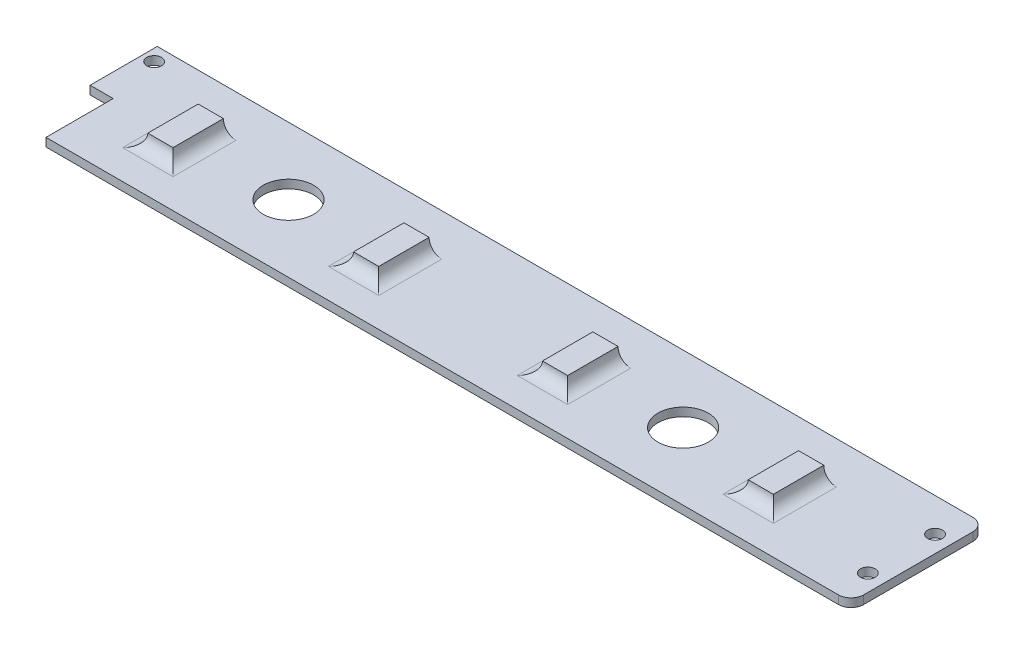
ISO-10303-21;
HEADER;
FILE_DESCRIPTION(('STEP AP214'),'2;1');
FILE_NAME('part.step','',(''),(''),'','','');
FILE_SCHEMA(('AUTOMOTIVE_DESIGN { 1 0 10303 214 1 1 1 1 }'));
ENDSEC;
DATA;
#1=APPLICATION_CONTEXT('core data for automotive mechanical design processes');
#2=APPLICATION_PROTOCOL_DEFINITION('international standard','automotive_design',2000,#1);
#3=PRODUCT_CONTEXT('',#1,'mechanical');
#4=PRODUCT('Part','Part','',(#3));
#5=PRODUCT_RELATED_PRODUCT_CATEGORY('part','',(#4));
#6=PRODUCT_DEFINITION_FORMATION('','',#4);
#7=PRODUCT_DEFINITION_CONTEXT('part definition',#1,'design');
#8=PRODUCT_DEFINITION('design','',#6,#7);
#9=PRODUCT_DEFINITION_SHAPE('','',#8);
#10=(LENGTH_UNIT() NAMED_UNIT(*) SI_UNIT(.MILLI.,.METRE.));
#11=(NAMED_UNIT(*) PLANE_ANGLE_UNIT() SI_UNIT($,.RADIAN.));
#12=(NAMED_UNIT(*) SI_UNIT($,.STERADIAN.) SOLID_ANGLE_UNIT());
#13=UNCERTAINTY_MEASURE_WITH_UNIT(LENGTH_MEASURE(1.E-05),#10,'distance_accuracy_value','');
#14=(GEOMETRIC_REPRESENTATION_CONTEXT(3) GLOBAL_UNCERTAINTY_ASSIGNED_CONTEXT((#13)) GLOBAL_UNIT_ASSIGNED_CONTEXT((#10,
#11,#12)) REPRESENTATION_CONTEXT('',''));
#15=CARTESIAN_POINT('',(0.,0.,0.));
#16=DIRECTION('',(0.,0.,1.));
#17=DIRECTION('',(1.,0.,0.));
#18=AXIS2_PLACEMENT_3D('',#15,#16,#17);
#19=CARTESIAN_POINT('',(-47.25,-2.01,-16.));
#20=DIRECTION('',(-1.,0.,0.));
#21=DIRECTION('',(0.,0.,1.));
#22=AXIS2_PLACEMENT_3D('',#19,#20,#21);
#23=PLANE('',#22);
#24=DIRECTION('',(0.,1.,0.));
#25=VECTOR('',#24,1.);
#26=CARTESIAN_POINT('',(-47.25,-2.01,0.));
#27=LINE('',#26,#25);
#28=CARTESIAN_POINT('',(-47.25,-2.,0.));
#29=VERTEX_POINT('',#28);
#30=CARTESIAN_POINT('',(-47.25,0.,0.));
#31=VERTEX_POINT('',#30);
#32=EDGE_CURVE('E11',#29,#31,#27,.T.);
#33=ORIENTED_EDGE('',*,*,#32,.T.);
#34=DIRECTION('',(0.,0.,-1.));
#35=VECTOR('',#34,1.);
#36=CARTESIAN_POINT('',(-47.25,0.,0.));
#37=LINE('',#36,#35);
#38=CARTESIAN_POINT('',(-47.25,0.,-16.));
#39=VERTEX_POINT('',#38);
#40=EDGE_CURVE('E149',#31,#39,#37,.T.);
#41=ORIENTED_EDGE('',*,*,#40,.T.);
#42=DIRECTION('',(0.,-1.,0.));
#43=VECTOR('',#42,1.);
#44=CARTESIAN_POINT('',(-47.25,-2.,-16.));
#45=LINE('',#44,#43);
#46=CARTESIAN_POINT('',(-47.25,-2.,-16.));
#47=VERTEX_POINT('',#46);
#48=EDGE_CURVE('E155',#39,#47,#45,.T.);
#49=ORIENTED_EDGE('',*,*,#48,.T.);
#50=DIRECTION('',(0.,0.,-1.));
#51=VECTOR('',#50,1.);
#52=CARTESIAN_POINT('',(-47.25,-2.,0.));
#53=LINE('',#52,#51);
#54=EDGE_CURVE('E133',#29,#47,#53,.T.);
#55=ORIENTED_EDGE('',*,*,#54,.F.);
#56=EDGE_LOOP('',(#33,#41,#49,#55));
#57=FACE_BOUND('',#56,.T.);
#58=ADVANCED_FACE('F37',(#57),#23,.T.);
#59=CARTESIAN_POINT('',(-47.25,-2.01,0.));
#60=DIRECTION('',(0.,0.,1.));
#61=DIRECTION('',(1.,0.,0.));
#62=AXIS2_PLACEMENT_3D('',#59,#60,#61);
#63=PLANE('',#62);
#64=DIRECTION('',(0.,1.,0.));
#65=VECTOR('',#64,1.);
#66=CARTESIAN_POINT('',(-41.75,-2.01,0.));
#67=LINE('',#66,#65);
#68=CARTESIAN_POINT('',(-41.75,-2.,0.));
#69=VERTEX_POINT('',#68);
#70=CARTESIAN_POINT('',(-41.75,0.,0.));
#71=VERTEX_POINT('',#70);
#72=EDGE_CURVE('E47',#69,#71,#67,.T.);
#73=ORIENTED_EDGE('',*,*,#72,.T.);
#74=DIRECTION('',(-1.,0.,0.));
#75=VECTOR('',#74,1.);
#76=CARTESIAN_POINT('',(0.,0.,0.));
#77=LINE('',#76,#75);
#78=EDGE_CURVE('E146',#71,#31,#77,.T.);
#79=ORIENTED_EDGE('',*,*,#78,.T.);
#80=ORIENTED_EDGE('',*,*,#32,.F.);
#81=DIRECTION('',(-1.,0.,0.));
#82=VECTOR('',#81,1.);
#83=CARTESIAN_POINT('',(0.,-2.,0.));
#84=LINE('',#83,#82);
#85=EDGE_CURVE('E137',#69,#29,#84,.T.);
#86=ORIENTED_EDGE('',*,*,#85,.F.);
#87=EDGE_LOOP('',(#73,#79,#80,#86));
#88=FACE_BOUND('',#87,.T.);
#89=ADVANCED_FACE('F521',(#88),#63,.T.);
#90=CARTESIAN_POINT('',(-41.75,-2.01,0.));
#91=DIRECTION('',(-1.,0.,0.));
#92=DIRECTION('',(0.,0.,1.));
#93=AXIS2_PLACEMENT_3D('',#90,#91,#92);
#94=PLANE('',#93);
#95=DIRECTION('',(0.,1.,0.));
#96=VECTOR('',#95,1.);
#97=CARTESIAN_POINT('',(-41.75,-2.,16.));
#98=LINE('',#97,#96);
#99=CARTESIAN_POINT('',(-41.75,-2.,16.));
#100=VERTEX_POINT('',#99);
#101=CARTESIAN_POINT('',(-41.75,0.,16.));
#102=VERTEX_POINT('',#101);
#103=EDGE_CURVE('E152',#100,#102,#98,.T.);
#104=ORIENTED_EDGE('',*,*,#103,.T.);
#105=DIRECTION('',(0.,0.,-1.));
#106=VECTOR('',#105,1.);
#107=CARTESIAN_POINT('',(-41.75,0.,0.));
#108=LINE('',#107,#106);
#109=EDGE_CURVE('E143',#102,#71,#108,.T.);
#110=ORIENTED_EDGE('',*,*,#109,.T.);
#111=ORIENTED_EDGE('',*,*,#72,.F.);
#112=DIRECTION('',(0.,0.,-1.));
#113=VECTOR('',#112,1.);
#114=CARTESIAN_POINT('',(-41.75,-2.,0.));
#115=LINE('',#114,#113);
#116=EDGE_CURVE('E140',#100,#69,#115,.T.);
#117=ORIENTED_EDGE('',*,*,#116,.F.);
#118=EDGE_LOOP('',(#104,#110,#111,#117));
#119=FACE_BOUND('',#118,.T.);
#120=ADVANCED_FACE('F513',(#119),#94,.T.);
#121=CARTESIAN_POINT('',(93.9999999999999,0.,4.));
#122=DIRECTION('',(0.,0.,-1.));
#123=DIRECTION('',(1.,0.,0.));
#124=AXIS2_PLACEMENT_3D('',#121,#122,#123);
#125=PLANE('',#124);
#126=DIRECTION('',(0.,-1.,0.));
#127=VECTOR('',#126,1.);
#128=CARTESIAN_POINT('',(116.25,2.25,4.));
#129=LINE('',#128,#127);
#130=CARTESIAN_POINT('',(116.25,2.25,4.));
#131=VERTEX_POINT('',#130);
#132=CARTESIAN_POINT('',(116.25,0.75,4.));
#133=VERTEX_POINT('',#132);
#134=EDGE_CURVE('E110',#131,#133,#129,.T.);
#135=ORIENTED_EDGE('',*,*,#134,.F.);
#136=DIRECTION('',(-1.,0.,0.));
#137=VECTOR('',#136,1.);
#138=CARTESIAN_POINT('',(120.75,2.25,4.));
#139=LINE('',#138,#137);
#140=CARTESIAN_POINT('',(120.75,2.25,4.));
#141=VERTEX_POINT('',#140);
#142=EDGE_CURVE('E100',#141,#131,#139,.T.);
#143=ORIENTED_EDGE('',*,*,#142,.F.);
#144=DIRECTION('',(0.,1.,0.));
#145=VECTOR('',#144,1.);
#146=CARTESIAN_POINT('',(120.75,0.75,4.));
#147=LINE('',#146,#145);
#148=CARTESIAN_POINT('',(120.75,0.75,4.));
#149=VERTEX_POINT('',#148);
#150=EDGE_CURVE('E94',#149,#141,#147,.T.);
#151=ORIENTED_EDGE('',*,*,#150,.F.);
#152=DIRECTION('',(1.,0.,0.));
#153=VECTOR('',#152,1.);
#154=CARTESIAN_POINT('',(116.25,0.75,4.));
#155=LINE('',#154,#153);
#156=EDGE_CURVE('E120',#133,#149,#155,.T.);
#157=ORIENTED_EDGE('',*,*,#156,.F.);
#158=EDGE_LOOP('',(#135,#143,#151,#157));
#159=FACE_BOUND('',#158,.T.);
#160=ADVANCED_FACE('F122',(#159),#125,.T.);
#161=CARTESIAN_POINT('',(93.9999999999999,0.,4.));
#162=DIRECTION('',(0.,0.,-1.));
#163=DIRECTION('',(1.,0.,0.));
#164=AXIS2_PLACEMENT_3D('',#161,#162,#163);
#165=PLANE('',#164);
#166=DIRECTION('',(0.,-1.,0.));
#167=VECTOR('',#166,1.);
#168=CARTESIAN_POINT('',(67.2499999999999,2.25,4.));
#169=LINE('',#168,#167);
#170=CARTESIAN_POINT('',(67.2499999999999,2.25,4.));
#171=VERTEX_POINT('',#170);
#172=CARTESIAN_POINT('',(67.2499999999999,0.75,4.));
#173=VERTEX_POINT('',#172);
#174=EDGE_CURVE('E314',#171,#173,#169,.T.);
#175=ORIENTED_EDGE('',*,*,#174,.F.);
#176=DIRECTION('',(-1.,0.,0.));
#177=VECTOR('',#176,1.);
#178=CARTESIAN_POINT('',(71.75,2.25,4.));
#179=LINE('',#178,#177);
#180=CARTESIAN_POINT('',(71.75,2.25,4.));
#181=VERTEX_POINT('',#180);
#182=EDGE_CURVE('E327',#181,#171,#179,.T.);
#183=ORIENTED_EDGE('',*,*,#182,.F.);
#184=DIRECTION('',(0.,1.,0.));
#185=VECTOR('',#184,1.);
#186=CARTESIAN_POINT('',(71.75,0.75,4.));
#187=LINE('',#186,#185);
#188=CARTESIAN_POINT('',(71.75,0.75,4.));
#189=VERTEX_POINT('',#188);
#190=EDGE_CURVE('E325',#189,#181,#187,.T.);
#191=ORIENTED_EDGE('',*,*,#190,.F.);
#192=DIRECTION('',(1.,0.,0.));
#193=VECTOR('',#192,1.);
#194=CARTESIAN_POINT('',(67.2499999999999,0.75,4.));
#195=LINE('',#194,#193);
#196=EDGE_CURVE('E303',#173,#189,#195,.T.);
#197=ORIENTED_EDGE('',*,*,#196,.F.);
#198=EDGE_LOOP('',(#175,#183,#191,#197));
#199=FACE_BOUND('',#198,.T.);
#200=ADVANCED_FACE('F498',(#199),#165,.T.);
#201=CARTESIAN_POINT('',(0.,0.,4.));
#202=DIRECTION('',(0.,0.,-1.));
#203=DIRECTION('',(-1.,0.,0.));
#204=AXIS2_PLACEMENT_3D('',#201,#202,#203);
#205=PLANE('',#204);
#206=DIRECTION('',(0.,-1.,0.));
#207=VECTOR('',#206,1.);
#208=CARTESIAN_POINT('',(26.75,2.25,4.));
#209=LINE('',#208,#207);
#210=CARTESIAN_POINT('',(26.75,2.25,4.));
#211=VERTEX_POINT('',#210);
#212=CARTESIAN_POINT('',(26.75,0.75,4.));
#213=VERTEX_POINT('',#212);
#214=EDGE_CURVE('E693',#211,#213,#209,.T.);
#215=ORIENTED_EDGE('',*,*,#214,.T.);
#216=DIRECTION('',(-1.,0.,0.));
#217=VECTOR('',#216,1.);
#218=CARTESIAN_POINT('',(26.75,0.75,4.));
#219=LINE('',#218,#217);
#220=CARTESIAN_POINT('',(22.25,0.75,4.));
#221=VERTEX_POINT('',#220);
#222=EDGE_CURVE('E696',#213,#221,#219,.T.);
#223=ORIENTED_EDGE('',*,*,#222,.T.);
#224=DIRECTION('',(0.,1.,0.));
#225=VECTOR('',#224,1.);
#226=CARTESIAN_POINT('',(22.25,0.75,4.));
#227=LINE('',#226,#225);
#228=CARTESIAN_POINT('',(22.25,2.25,4.));
#229=VERTEX_POINT('',#228);
#230=EDGE_CURVE('E700',#221,#229,#227,.T.);
#231=ORIENTED_EDGE('',*,*,#230,.T.);
#232=DIRECTION('',(1.,0.,0.));
#233=VECTOR('',#232,1.);
#234=CARTESIAN_POINT('',(22.25,2.25,4.));
#235=LINE('',#234,#233);
#236=EDGE_CURVE('E703',#229,#211,#235,.T.);
#237=ORIENTED_EDGE('',*,*,#236,.T.);
#238=EDGE_LOOP('',(#215,#223,#231,#237));
#239=FACE_BOUND('',#238,.T.);
#240=ADVANCED_FACE('F519',(#239),#205,.T.);
#241=CARTESIAN_POINT('',(0.,0.,4.));
#242=DIRECTION('',(0.,0.,-1.));
#243=DIRECTION('',(-1.,0.,0.));
#244=AXIS2_PLACEMENT_3D('',#241,#242,#243);
#245=PLANE('',#244);
#246=DIRECTION('',(0.,-1.,0.));
#247=VECTOR('',#246,1.);
#248=CARTESIAN_POINT('',(-22.25,2.25,4.));
#249=LINE('',#248,#247);
#250=CARTESIAN_POINT('',(-22.25,2.25,4.));
#251=VERTEX_POINT('',#250);
#252=CARTESIAN_POINT('',(-22.25,0.75,4.));
#253=VERTEX_POINT('',#252);
#254=EDGE_CURVE('E218',#251,#253,#249,.T.);
#255=ORIENTED_EDGE('',*,*,#254,.T.);
#256=DIRECTION('',(-1.,0.,0.));
#257=VECTOR('',#256,1.);
#258=CARTESIAN_POINT('',(-22.25,0.75,4.));
#259=LINE('',#258,#257);
#260=CARTESIAN_POINT('',(-26.75,0.75,4.));
#261=VERTEX_POINT('',#260);
#262=EDGE_CURVE('E233',#253,#261,#259,.T.);
#263=ORIENTED_EDGE('',*,*,#262,.T.);
#264=DIRECTION('',(0.,1.,0.));
#265=VECTOR('',#264,1.);
#266=CARTESIAN_POINT('',(-26.75,0.75,4.));
#267=LINE('',#266,#265);
#268=CARTESIAN_POINT('',(-26.75,2.25,4.));
#269=VERTEX_POINT('',#268);
#270=EDGE_CURVE('E230',#261,#269,#267,.T.);
#271=ORIENTED_EDGE('',*,*,#270,.T.);
#272=DIRECTION('',(1.,0.,0.));
#273=VECTOR('',#272,1.);
#274=CARTESIAN_POINT('',(-26.75,2.25,4.));
#275=LINE('',#274,#273);
#276=EDGE_CURVE('E205',#269,#251,#275,.T.);
#277=ORIENTED_EDGE('',*,*,#276,.T.);
#278=EDGE_LOOP('',(#255,#263,#271,#277));
#279=FACE_BOUND('',#278,.T.);
#280=ADVANCED_FACE('F785',(#279),#245,.T.);
#281=CARTESIAN_POINT('',(120.75,0.75,4.));
#282=DIRECTION('',(-1.,0.,0.));
#283=DIRECTION('',(0.,0.,1.));
#284=AXIS2_PLACEMENT_3D('',#281,#282,#283);
#285=PLANE('',#284);
#286=DIRECTION('',(0.,1.,0.));
#287=VECTOR('',#286,1.);
#288=CARTESIAN_POINT('',(120.75,0.75,-6.));
#289=LINE('',#288,#287);
#290=CARTESIAN_POINT('',(120.75,0.75,-6.));
#291=VERTEX_POINT('',#290);
#292=CARTESIAN_POINT('',(120.75,2.25,-6.));
#293=VERTEX_POINT('',#292);
#294=EDGE_CURVE('E126',#291,#293,#289,.T.);
#295=ORIENTED_EDGE('',*,*,#294,.F.);
#296=DIRECTION('',(0.,0.,-1.));
#297=VECTOR('',#296,1.);
#298=CARTESIAN_POINT('',(120.75,0.75,4.));
#299=LINE('',#298,#297);
#300=EDGE_CURVE('E332',#149,#291,#299,.T.);
#301=ORIENTED_EDGE('',*,*,#300,.F.);
#302=ORIENTED_EDGE('',*,*,#150,.T.);
#303=DIRECTION('',(0.,0.,-1.));
#304=VECTOR('',#303,1.);
#305=CARTESIAN_POINT('',(120.75,2.25,4.));
#306=LINE('',#305,#304);
#307=EDGE_CURVE('E107',#141,#293,#306,.T.);
#308=ORIENTED_EDGE('',*,*,#307,.T.);
#309=EDGE_LOOP('',(#295,#301,#302,#308));
#310=FACE_BOUND('',#309,.T.);
#311=ADVANCED_FACE('F343',(#310),#285,.T.);
#312=CARTESIAN_POINT('',(116.25,0.75,4.));
#313=DIRECTION('',(0.,1.,0.));
#314=DIRECTION('',(0.,0.,1.));
#315=AXIS2_PLACEMENT_3D('',#312,#313,#314);
#316=PLANE('',#315);
#317=DIRECTION('',(1.,0.,0.));
#318=VECTOR('',#317,1.);
#319=CARTESIAN_POINT('',(116.25,0.75,-6.));
#320=LINE('',#319,#318);
#321=CARTESIAN_POINT('',(116.25,0.75,-6.));
#322=VERTEX_POINT('',#321);
#323=EDGE_CURVE('E123',#322,#291,#320,.T.);
#324=ORIENTED_EDGE('',*,*,#323,.F.);
#325=DIRECTION('',(0.,0.,-1.));
#326=VECTOR('',#325,1.);
#327=CARTESIAN_POINT('',(116.25,0.75,4.));
#328=LINE('',#327,#326);
#329=EDGE_CURVE('E288',#133,#322,#328,.T.);
#330=ORIENTED_EDGE('',*,*,#329,.F.);
#331=ORIENTED_EDGE('',*,*,#156,.T.);
#332=ORIENTED_EDGE('',*,*,#300,.T.);
#333=EDGE_LOOP('',(#324,#330,#331,#332));
#334=FACE_BOUND('',#333,.T.);
#335=ADVANCED_FACE('F341',(#334),#316,.T.);
#336=CARTESIAN_POINT('',(116.25,2.25,4.));
#337=DIRECTION('',(1.,0.,0.));
#338=DIRECTION('',(0.,0.,-1.));
#339=AXIS2_PLACEMENT_3D('',#336,#337,#338);
#340=PLANE('',#339);
#341=DIRECTION('',(0.,-1.,0.));
#342=VECTOR('',#341,1.);
#343=CARTESIAN_POINT('',(116.25,2.25,-6.));
#344=LINE('',#343,#342);
#345=CARTESIAN_POINT('',(116.25,2.25,-6.));
#346=VERTEX_POINT('',#345);
#347=EDGE_CURVE('E119',#346,#322,#344,.T.);
#348=ORIENTED_EDGE('',*,*,#347,.F.);
#349=DIRECTION('',(0.,0.,-1.));
#350=VECTOR('',#349,1.);
#351=CARTESIAN_POINT('',(116.25,2.25,4.));
#352=LINE('',#351,#350);
#353=EDGE_CURVE('E105',#131,#346,#352,.T.);
#354=ORIENTED_EDGE('',*,*,#353,.F.);
#355=ORIENTED_EDGE('',*,*,#134,.T.);
#356=ORIENTED_EDGE('',*,*,#329,.T.);
#357=EDGE_LOOP('',(#348,#354,#355,#356));
#358=FACE_BOUND('',#357,.T.);
#359=ADVANCED_FACE('F115',(#358),#340,.T.);
#360=CARTESIAN_POINT('',(120.75,2.25,4.));
#361=DIRECTION('',(0.,-1.,0.));
#362=DIRECTION('',(0.,0.,-1.));
#363=AXIS2_PLACEMENT_3D('',#360,#361,#362);
#364=PLANE('',#363);
#365=DIRECTION('',(-1.,0.,0.));
#366=VECTOR('',#365,1.);
#367=CARTESIAN_POINT('',(120.75,2.25,-6.));
#368=LINE('',#367,#366);
#369=EDGE_CURVE('E337',#293,#346,#368,.T.);
#370=ORIENTED_EDGE('',*,*,#369,.F.);
#371=ORIENTED_EDGE('',*,*,#307,.F.);
#372=ORIENTED_EDGE('',*,*,#142,.T.);
#373=ORIENTED_EDGE('',*,*,#353,.T.);
#374=EDGE_LOOP('',(#370,#371,#372,#373));
#375=FACE_BOUND('',#374,.T.);
#376=ADVANCED_FACE('F103',(#375),#364,.T.);
#377=CARTESIAN_POINT('',(93.9999999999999,3.,0.));
#378=DIRECTION('',(0.,1.,0.));
#379=DIRECTION('',(0.,0.,1.));
#380=AXIS2_PLACEMENT_3D('',#377,#378,#379);
#381=PLANE('',#380);
#382=DIRECTION('',(0.,0.,-1.));
#383=VECTOR('',#382,1.);
#384=CARTESIAN_POINT('',(115.5,3.,-6.));
#385=LINE('',#384,#383);
#386=CARTESIAN_POINT('',(115.5,3.,6.));
#387=VERTEX_POINT('',#386);
#388=CARTESIAN_POINT('',(115.5,3.,-6.));
#389=VERTEX_POINT('',#388);
#390=EDGE_CURVE('E289',#387,#389,#385,.T.);
#391=ORIENTED_EDGE('',*,*,#390,.F.);
#392=DIRECTION('',(-1.,0.,0.));
#393=VECTOR('',#392,1.);
#394=CARTESIAN_POINT('',(121.5,3.,6.));
#395=LINE('',#394,#393);
#396=CARTESIAN_POINT('',(121.5,3.,6.));
#397=VERTEX_POINT('',#396);
#398=EDGE_CURVE('E295',#397,#387,#395,.T.);
#399=ORIENTED_EDGE('',*,*,#398,.F.);
#400=DIRECTION('',(0.,0.,1.));
#401=VECTOR('',#400,1.);
#402=CARTESIAN_POINT('',(121.5,3.,-6.));
#403=LINE('',#402,#401);
#404=CARTESIAN_POINT('',(121.5,3.,-6.));
#405=VERTEX_POINT('',#404);
#406=EDGE_CURVE('E292',#405,#397,#403,.T.);
#407=ORIENTED_EDGE('',*,*,#406,.F.);
#408=DIRECTION('',(1.,0.,0.));
#409=VECTOR('',#408,1.);
#410=CARTESIAN_POINT('',(121.5,3.,-6.));
#411=LINE('',#410,#409);
#412=EDGE_CURVE('E273',#389,#405,#411,.T.);
#413=ORIENTED_EDGE('',*,*,#412,.F.);
#414=EDGE_LOOP('',(#391,#399,#407,#413));
#415=FACE_BOUND('',#414,.T.);
#416=ADVANCED_FACE('F502',(#415),#381,.T.);
#417=CARTESIAN_POINT('',(71.75,0.75,4.));
#418=DIRECTION('',(-1.,0.,0.));
#419=DIRECTION('',(0.,0.,1.));
#420=AXIS2_PLACEMENT_3D('',#417,#418,#419);
#421=PLANE('',#420);
#422=DIRECTION('',(0.,1.,0.));
#423=VECTOR('',#422,1.);
#424=CARTESIAN_POINT('',(71.75,0.75,-6.));
#425=LINE('',#424,#423);
#426=CARTESIAN_POINT('',(71.75,0.75,-6.));
#427=VERTEX_POINT('',#426);
#428=CARTESIAN_POINT('',(71.75,2.25,-6.));
#429=VERTEX_POINT('',#428);
#430=EDGE_CURVE('E313',#427,#429,#425,.T.);
#431=ORIENTED_EDGE('',*,*,#430,.F.);
#432=DIRECTION('',(0.,0.,-1.));
#433=VECTOR('',#432,1.);
#434=CARTESIAN_POINT('',(71.75,0.75,4.));
#435=LINE('',#434,#433);
#436=EDGE_CURVE('E305',#189,#427,#435,.T.);
#437=ORIENTED_EDGE('',*,*,#436,.F.);
#438=ORIENTED_EDGE('',*,*,#190,.T.);
#439=DIRECTION('',(0.,0.,-1.));
#440=VECTOR('',#439,1.);
#441=CARTESIAN_POINT('',(71.75,2.25,4.));
#442=LINE('',#441,#440);
#443=EDGE_CURVE('E56',#181,#429,#442,.T.);
#444=ORIENTED_EDGE('',*,*,#443,.T.);
#445=EDGE_LOOP('',(#431,#437,#438,#444));
#446=FACE_BOUND('',#445,.T.);
#447=ADVANCED_FACE('F500',(#446),#421,.T.);
#448=CARTESIAN_POINT('',(67.2499999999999,0.75,4.));
#449=DIRECTION('',(0.,1.,0.));
#450=DIRECTION('',(0.,0.,1.));
#451=AXIS2_PLACEMENT_3D('',#448,#449,#450);
#452=PLANE('',#451);
#453=DIRECTION('',(1.,0.,0.));
#454=VECTOR('',#453,1.);
#455=CARTESIAN_POINT('',(67.2499999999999,0.75,-6.));
#456=LINE('',#455,#454);
#457=CARTESIAN_POINT('',(67.2499999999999,0.75,-6.));
#458=VERTEX_POINT('',#457);
#459=EDGE_CURVE('E310',#458,#427,#456,.T.);
#460=ORIENTED_EDGE('',*,*,#459,.F.);
#461=DIRECTION('',(0.,0.,-1.));
#462=VECTOR('',#461,1.);
#463=CARTESIAN_POINT('',(67.2499999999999,0.75,4.));
#464=LINE('',#463,#462);
#465=EDGE_CURVE('E307',#173,#458,#464,.T.);
#466=ORIENTED_EDGE('',*,*,#465,.F.);
#467=ORIENTED_EDGE('',*,*,#196,.T.);
#468=ORIENTED_EDGE('',*,*,#436,.T.);
#469=EDGE_LOOP('',(#460,#466,#467,#468));
#470=FACE_BOUND('',#469,.T.);
#471=ADVANCED_FACE('F486',(#470),#452,.T.);
#472=CARTESIAN_POINT('',(67.2499999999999,2.25,4.));
#473=DIRECTION('',(1.,0.,0.));
#474=DIRECTION('',(0.,0.,-1.));
#475=AXIS2_PLACEMENT_3D('',#472,#473,#474);
#476=PLANE('',#475);
#477=DIRECTION('',(0.,-1.,0.));
#478=VECTOR('',#477,1.);
#479=CARTESIAN_POINT('',(67.2499999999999,2.25,-6.));
#480=LINE('',#479,#478);
#481=CARTESIAN_POINT('',(67.2499999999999,2.25,-5.99999999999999));
#482=VERTEX_POINT('',#481);
#483=EDGE_CURVE('E320',#482,#458,#480,.T.);
#484=ORIENTED_EDGE('',*,*,#483,.F.);
#485=DIRECTION('',(0.,0.,-1.));
#486=VECTOR('',#485,1.);
#487=CARTESIAN_POINT('',(67.2499999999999,2.25,4.));
#488=LINE('',#487,#486);
#489=EDGE_CURVE('E300',#171,#482,#488,.T.);
#490=ORIENTED_EDGE('',*,*,#489,.F.);
#491=ORIENTED_EDGE('',*,*,#174,.T.);
#492=ORIENTED_EDGE('',*,*,#465,.T.);
#493=EDGE_LOOP('',(#484,#490,#491,#492));
#494=FACE_BOUND('',#493,.T.);
#495=ADVANCED_FACE('F490',(#494),#476,.T.);
#496=CARTESIAN_POINT('',(71.75,2.25,4.));
#497=DIRECTION('',(0.,-1.,0.));
#498=DIRECTION('',(0.,0.,-1.));
#499=AXIS2_PLACEMENT_3D('',#496,#497,#498);
#500=PLANE('',#499);
#501=DIRECTION('',(-1.,0.,0.));
#502=VECTOR('',#501,1.);
#503=CARTESIAN_POINT('',(71.75,2.25,-6.));
#504=LINE('',#503,#502);
#505=EDGE_CURVE('E317',#429,#482,#504,.T.);
#506=ORIENTED_EDGE('',*,*,#505,.F.);
#507=ORIENTED_EDGE('',*,*,#443,.F.);
#508=ORIENTED_EDGE('',*,*,#182,.T.);
#509=ORIENTED_EDGE('',*,*,#489,.T.);
#510=EDGE_LOOP('',(#506,#507,#508,#509));
#511=FACE_BOUND('',#510,.T.);
#512=ADVANCED_FACE('F495',(#511),#500,.T.);
#513=CARTESIAN_POINT('',(93.9999999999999,3.,0.));
#514=DIRECTION('',(0.,1.,0.));
#515=DIRECTION('',(0.,0.,1.));
#516=AXIS2_PLACEMENT_3D('',#513,#514,#515);
#517=PLANE('',#516);
#518=DIRECTION('',(0.,0.,-1.));
#519=VECTOR('',#518,1.);
#520=CARTESIAN_POINT('',(66.4999999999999,3.,-5.99999999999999));
#521=LINE('',#520,#519);
#522=CARTESIAN_POINT('',(66.4999999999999,3.,6.00000000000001));
#523=VERTEX_POINT('',#522);
#524=CARTESIAN_POINT('',(66.4999999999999,3.,-5.99999999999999));
#525=VERTEX_POINT('',#524);
#526=EDGE_CURVE('E274',#523,#525,#521,.T.);
#527=ORIENTED_EDGE('',*,*,#526,.F.);
#528=DIRECTION('',(-1.,0.,0.));
#529=VECTOR('',#528,1.);
#530=CARTESIAN_POINT('',(72.5,3.,6.00000000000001));
#531=LINE('',#530,#529);
#532=CARTESIAN_POINT('',(72.5,3.,6.00000000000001));
#533=VERTEX_POINT('',#532);
#534=EDGE_CURVE('E280',#533,#523,#531,.T.);
#535=ORIENTED_EDGE('',*,*,#534,.F.);
#536=DIRECTION('',(0.,0.,1.));
#537=VECTOR('',#536,1.);
#538=CARTESIAN_POINT('',(72.5,3.,-5.99999999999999));
#539=LINE('',#538,#537);
#540=CARTESIAN_POINT('',(72.5,3.,-5.99999999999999));
#541=VERTEX_POINT('',#540);
#542=EDGE_CURVE('E277',#541,#533,#539,.T.);
#543=ORIENTED_EDGE('',*,*,#542,.F.);
#544=DIRECTION('',(1.,0.,0.));
#545=VECTOR('',#544,1.);
#546=CARTESIAN_POINT('',(72.5,3.,-5.99999999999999));
#547=LINE('',#546,#545);
#548=EDGE_CURVE('E269',#525,#541,#547,.T.);
#549=ORIENTED_EDGE('',*,*,#548,.F.);
#550=EDGE_LOOP('',(#527,#535,#543,#549));
#551=FACE_BOUND('',#550,.T.);
#552=ADVANCED_FACE('F748',(#551),#517,.T.);
#553=CARTESIAN_POINT('',(22.25,0.75,4.));
#554=DIRECTION('',(-1.,0.,0.));
#555=DIRECTION('',(0.,0.,1.));
#556=AXIS2_PLACEMENT_3D('',#553,#554,#555);
#557=PLANE('',#556);
#558=DIRECTION('',(0.,1.,0.));
#559=VECTOR('',#558,1.);
#560=CARTESIAN_POINT('',(22.25,0.75,-6.));
#561=LINE('',#560,#559);
#562=CARTESIAN_POINT('',(22.25,0.75,-6.));
#563=VERTEX_POINT('',#562);
#564=CARTESIAN_POINT('',(22.25,2.25,-6.));
#565=VERTEX_POINT('',#564);
#566=EDGE_CURVE('E711',#563,#565,#561,.T.);
#567=ORIENTED_EDGE('',*,*,#566,.T.);
#568=DIRECTION('',(0.,0.,-1.));
#569=VECTOR('',#568,1.);
#570=CARTESIAN_POINT('',(22.25,2.25,4.));
#571=LINE('',#570,#569);
#572=EDGE_CURVE('E717',#229,#565,#571,.T.);
#573=ORIENTED_EDGE('',*,*,#572,.F.);
#574=ORIENTED_EDGE('',*,*,#230,.F.);
#575=DIRECTION('',(0.,0.,-1.));
#576=VECTOR('',#575,1.);
#577=CARTESIAN_POINT('',(22.25,0.75,4.));
#578=LINE('',#577,#576);
#579=EDGE_CURVE('E719',#221,#563,#578,.T.);
#580=ORIENTED_EDGE('',*,*,#579,.T.);
#581=EDGE_LOOP('',(#567,#573,#574,#580));
#582=FACE_BOUND('',#581,.T.);
#583=ADVANCED_FACE('F734',(#582),#557,.F.);
#584=CARTESIAN_POINT('',(22.25,2.25,4.));
#585=DIRECTION('',(0.,1.,0.));
#586=DIRECTION('',(0.,0.,1.));
#587=AXIS2_PLACEMENT_3D('',#584,#585,#586);
#588=PLANE('',#587);
#589=DIRECTION('',(1.,0.,0.));
#590=VECTOR('',#589,1.);
#591=CARTESIAN_POINT('',(22.25,2.25,-6.));
#592=LINE('',#591,#590);
#593=CARTESIAN_POINT('',(26.75,2.25,-6.));
#594=VERTEX_POINT('',#593);
#595=EDGE_CURVE('E697',#565,#594,#592,.T.);
#596=ORIENTED_EDGE('',*,*,#595,.T.);
#597=DIRECTION('',(0.,0.,-1.));
#598=VECTOR('',#597,1.);
#599=CARTESIAN_POINT('',(26.75,2.25,4.));
#600=LINE('',#599,#598);
#601=EDGE_CURVE('E162',#211,#594,#600,.T.);
#602=ORIENTED_EDGE('',*,*,#601,.F.);
#603=ORIENTED_EDGE('',*,*,#236,.F.);
#604=ORIENTED_EDGE('',*,*,#572,.T.);
#605=EDGE_LOOP('',(#596,#602,#603,#604));
#606=FACE_BOUND('',#605,.T.);
#607=ADVANCED_FACE('F740',(#606),#588,.F.);
#608=CARTESIAN_POINT('',(26.75,2.25,4.));
#609=DIRECTION('',(1.,0.,0.));
#610=DIRECTION('',(0.,0.,-1.));
#611=AXIS2_PLACEMENT_3D('',#608,#609,#610);
#612=PLANE('',#611);
#613=DIRECTION('',(0.,-1.,0.));
#614=VECTOR('',#613,1.);
#615=CARTESIAN_POINT('',(26.75,2.25,-6.));
#616=LINE('',#615,#614);
#617=CARTESIAN_POINT('',(26.75,0.75,-5.99999999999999));
#618=VERTEX_POINT('',#617);
#619=EDGE_CURVE('E682',#594,#618,#616,.T.);
#620=ORIENTED_EDGE('',*,*,#619,.T.);
#621=DIRECTION('',(0.,0.,-1.));
#622=VECTOR('',#621,1.);
#623=CARTESIAN_POINT('',(26.75,0.75,4.));
#624=LINE('',#623,#622);
#625=EDGE_CURVE('E706',#213,#618,#624,.T.);
#626=ORIENTED_EDGE('',*,*,#625,.F.);
#627=ORIENTED_EDGE('',*,*,#214,.F.);
#628=ORIENTED_EDGE('',*,*,#601,.T.);
#629=EDGE_LOOP('',(#620,#626,#627,#628));
#630=FACE_BOUND('',#629,.T.);
#631=ADVANCED_FACE('F738',(#630),#612,.F.);
#632=CARTESIAN_POINT('',(26.75,0.75,4.));
#633=DIRECTION('',(0.,-1.,0.));
#634=DIRECTION('',(0.,0.,-1.));
#635=AXIS2_PLACEMENT_3D('',#632,#633,#634);
#636=PLANE('',#635);
#637=DIRECTION('',(-1.,0.,0.));
#638=VECTOR('',#637,1.);
#639=CARTESIAN_POINT('',(26.75,0.75,-6.));
#640=LINE('',#639,#638);
#641=EDGE_CURVE('E708',#618,#563,#640,.T.);
#642=ORIENTED_EDGE('',*,*,#641,.T.);
#643=ORIENTED_EDGE('',*,*,#579,.F.);
#644=ORIENTED_EDGE('',*,*,#222,.F.);
#645=ORIENTED_EDGE('',*,*,#625,.T.);
#646=EDGE_LOOP('',(#642,#643,#644,#645));
#647=FACE_BOUND('',#646,.T.);
#648=ADVANCED_FACE('F724',(#647),#636,.F.);
#649=CARTESIAN_POINT('',(0.,3.,0.));
#650=DIRECTION('',(0.,1.,0.));
#651=DIRECTION('',(0.,0.,1.));
#652=AXIS2_PLACEMENT_3D('',#649,#650,#651);
#653=PLANE('',#652);
#654=DIRECTION('',(0.,0.,-1.));
#655=VECTOR('',#654,1.);
#656=CARTESIAN_POINT('',(27.5,3.,-5.99999999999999));
#657=LINE('',#656,#655);
#658=CARTESIAN_POINT('',(27.5,3.,6.00000000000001));
#659=VERTEX_POINT('',#658);
#660=CARTESIAN_POINT('',(27.5,3.,-5.99999999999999));
#661=VERTEX_POINT('',#660);
#662=EDGE_CURVE('E683',#659,#661,#657,.T.);
#663=ORIENTED_EDGE('',*,*,#662,.T.);
#664=DIRECTION('',(-1.,0.,0.));
#665=VECTOR('',#664,1.);
#666=CARTESIAN_POINT('',(21.5,3.,-5.99999999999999));
#667=LINE('',#666,#665);
#668=CARTESIAN_POINT('',(21.5,3.,-5.99999999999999));
#669=VERTEX_POINT('',#668);
#670=EDGE_CURVE('E688',#661,#669,#667,.T.);
#671=ORIENTED_EDGE('',*,*,#670,.T.);
#672=DIRECTION('',(0.,0.,1.));
#673=VECTOR('',#672,1.);
#674=CARTESIAN_POINT('',(21.5,3.,-5.99999999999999));
#675=LINE('',#674,#673);
#676=CARTESIAN_POINT('',(21.5,3.,6.00000000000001));
#677=VERTEX_POINT('',#676);
#678=EDGE_CURVE('E686',#669,#677,#675,.T.);
#679=ORIENTED_EDGE('',*,*,#678,.T.);
#680=DIRECTION('',(1.,0.,0.));
#681=VECTOR('',#680,1.);
#682=CARTESIAN_POINT('',(21.5,3.,6.00000000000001));
#683=LINE('',#682,#681);
#684=EDGE_CURVE('E679',#677,#659,#683,.T.);
#685=ORIENTED_EDGE('',*,*,#684,.T.);
#686=EDGE_LOOP('',(#663,#671,#679,#685));
#687=FACE_BOUND('',#686,.T.);
#688=ADVANCED_FACE('F754',(#687),#653,.T.);
#689=CARTESIAN_POINT('',(-26.75,0.75,4.));
#690=DIRECTION('',(-1.,0.,0.));
#691=DIRECTION('',(0.,0.,1.));
#692=AXIS2_PLACEMENT_3D('',#689,#690,#691);
#693=PLANE('',#692);
#694=DIRECTION('',(0.,1.,0.));
#695=VECTOR('',#694,1.);
#696=CARTESIAN_POINT('',(-26.75,0.75,-6.));
#697=LINE('',#696,#695);
#698=CARTESIAN_POINT('',(-26.75,0.75,-6.));
#699=VERTEX_POINT('',#698);
#700=CARTESIAN_POINT('',(-26.75,2.25,-6.));
#701=VERTEX_POINT('',#700);
#702=EDGE_CURVE('E217',#699,#701,#697,.T.);
#703=ORIENTED_EDGE('',*,*,#702,.T.);
#704=DIRECTION('',(0.,0.,-1.));
#705=VECTOR('',#704,1.);
#706=CARTESIAN_POINT('',(-26.75,2.25,4.));
#707=LINE('',#706,#705);
#708=EDGE_CURVE('E209',#269,#701,#707,.T.);
#709=ORIENTED_EDGE('',*,*,#708,.F.);
#710=ORIENTED_EDGE('',*,*,#270,.F.);
#711=DIRECTION('',(0.,0.,-1.));
#712=VECTOR('',#711,1.);
#713=CARTESIAN_POINT('',(-26.75,0.75,4.));
#714=LINE('',#713,#712);
#715=EDGE_CURVE('E206',#261,#699,#714,.T.);
#716=ORIENTED_EDGE('',*,*,#715,.T.);
#717=EDGE_LOOP('',(#703,#709,#710,#716));
#718=FACE_BOUND('',#717,.T.);
#719=ADVANCED_FACE('F778',(#718),#693,.F.);
#720=CARTESIAN_POINT('',(-26.75,2.25,4.));
#721=DIRECTION('',(0.,1.,0.));
#722=DIRECTION('',(0.,0.,1.));
#723=AXIS2_PLACEMENT_3D('',#720,#721,#722);
#724=PLANE('',#723);
#725=DIRECTION('',(1.,0.,0.));
#726=VECTOR('',#725,1.);
#727=CARTESIAN_POINT('',(-26.75,2.25,-6.));
#728=LINE('',#727,#726);
#729=CARTESIAN_POINT('',(-22.25,2.25,-6.));
#730=VERTEX_POINT('',#729);
#731=EDGE_CURVE('E214',#701,#730,#728,.T.);
#732=ORIENTED_EDGE('',*,*,#731,.T.);
#733=DIRECTION('',(0.,0.,-1.));
#734=VECTOR('',#733,1.);
#735=CARTESIAN_POINT('',(-22.25,2.25,4.));
#736=LINE('',#735,#734);
#737=EDGE_CURVE('E199',#251,#730,#736,.T.);
#738=ORIENTED_EDGE('',*,*,#737,.F.);
#739=ORIENTED_EDGE('',*,*,#276,.F.);
#740=ORIENTED_EDGE('',*,*,#708,.T.);
#741=EDGE_LOOP('',(#732,#738,#739,#740));
#742=FACE_BOUND('',#741,.T.);
#743=ADVANCED_FACE('F773',(#742),#724,.F.);
#744=CARTESIAN_POINT('',(-22.25,2.25,4.));
#745=DIRECTION('',(1.,0.,0.));
#746=DIRECTION('',(0.,0.,-1.));
#747=AXIS2_PLACEMENT_3D('',#744,#745,#746);
#748=PLANE('',#747);
#749=DIRECTION('',(0.,-1.,0.));
#750=VECTOR('',#749,1.);
#751=CARTESIAN_POINT('',(-22.25,2.25,-6.));
#752=LINE('',#751,#750);
#753=CARTESIAN_POINT('',(-22.25,0.75,-6.));
#754=VERTEX_POINT('',#753);
#755=EDGE_CURVE('E224',#730,#754,#752,.T.);
#756=ORIENTED_EDGE('',*,*,#755,.T.);
#757=DIRECTION('',(0.,0.,-1.));
#758=VECTOR('',#757,1.);
#759=CARTESIAN_POINT('',(-22.25,0.75,4.));
#760=LINE('',#759,#758);
#761=EDGE_CURVE('E202',#253,#754,#760,.T.);
#762=ORIENTED_EDGE('',*,*,#761,.F.);
#763=ORIENTED_EDGE('',*,*,#254,.F.);
#764=ORIENTED_EDGE('',*,*,#737,.T.);
#765=EDGE_LOOP('',(#756,#762,#763,#764));
#766=FACE_BOUND('',#765,.T.);
#767=ADVANCED_FACE('F770',(#766),#748,.F.);
#768=CARTESIAN_POINT('',(-22.25,0.75,4.));
#769=DIRECTION('',(0.,-1.,0.));
#770=DIRECTION('',(0.,0.,-1.));
#771=AXIS2_PLACEMENT_3D('',#768,#769,#770);
#772=PLANE('',#771);
#773=DIRECTION('',(-1.,0.,0.));
#774=VECTOR('',#773,1.);
#775=CARTESIAN_POINT('',(-22.25,0.75,-6.));
#776=LINE('',#775,#774);
#777=EDGE_CURVE('E221',#754,#699,#776,.T.);
#778=ORIENTED_EDGE('',*,*,#777,.T.);
#779=ORIENTED_EDGE('',*,*,#715,.F.);
#780=ORIENTED_EDGE('',*,*,#262,.F.);
#781=ORIENTED_EDGE('',*,*,#761,.T.);
#782=EDGE_LOOP('',(#778,#779,#780,#781));
#783=FACE_BOUND('',#782,.T.);
#784=ADVANCED_FACE('F763',(#783),#772,.F.);
#785=CARTESIAN_POINT('',(0.,3.,0.));
#786=DIRECTION('',(0.,1.,0.));
#787=DIRECTION('',(0.,0.,1.));
#788=AXIS2_PLACEMENT_3D('',#785,#786,#787);
#789=PLANE('',#788);
#790=DIRECTION('',(0.,0.,-1.));
#791=VECTOR('',#790,1.);
#792=CARTESIAN_POINT('',(-21.5,3.,-6.));
#793=LINE('',#792,#791);
#794=CARTESIAN_POINT('',(-21.5,3.,6.));
#795=VERTEX_POINT('',#794);
#796=CARTESIAN_POINT('',(-21.5,3.,-6.));
#797=VERTEX_POINT('',#796);
#798=EDGE_CURVE('E186',#795,#797,#793,.T.);
#799=ORIENTED_EDGE('',*,*,#798,.T.);
#800=DIRECTION('',(-1.,0.,0.));
#801=VECTOR('',#800,1.);
#802=CARTESIAN_POINT('',(-27.5,3.,-6.));
#803=LINE('',#802,#801);
#804=CARTESIAN_POINT('',(-27.5,3.,-6.));
#805=VERTEX_POINT('',#804);
#806=EDGE_CURVE('E189',#797,#805,#803,.T.);
#807=ORIENTED_EDGE('',*,*,#806,.T.);
#808=DIRECTION('',(0.,0.,1.));
#809=VECTOR('',#808,1.);
#810=CARTESIAN_POINT('',(-27.5,3.,-6.));
#811=LINE('',#810,#809);
#812=CARTESIAN_POINT('',(-27.5,3.,6.));
#813=VERTEX_POINT('',#812);
#814=EDGE_CURVE('E193',#805,#813,#811,.T.);
#815=ORIENTED_EDGE('',*,*,#814,.T.);
#816=DIRECTION('',(1.,0.,0.));
#817=VECTOR('',#816,1.);
#818=CARTESIAN_POINT('',(-27.5,3.,6.));
#819=LINE('',#818,#817);
#820=EDGE_CURVE('E196',#813,#795,#819,.T.);
#821=ORIENTED_EDGE('',*,*,#820,.T.);
#822=EDGE_LOOP('',(#799,#807,#815,#821));
#823=FACE_BOUND('',#822,.T.);
#824=ADVANCED_FACE('F759',(#823),#789,.T.);
#825=CARTESIAN_POINT('',(112.5,3.,0.));
#826=DIRECTION('',(0.,0.,-1.));
#827=DIRECTION('',(-1.,0.,0.));
#828=AXIS2_PLACEMENT_3D('',#825,#826,#827);
#829=CYLINDRICAL_SURFACE('',#828,3.);
#830=CARTESIAN_POINT('',(112.5,3.,-6.));
#831=DIRECTION('',(0.,0.,-1.));
#832=DIRECTION('',(-1.,0.,0.));
#833=AXIS2_PLACEMENT_3D('',#830,#831,#832);
#834=CIRCLE('',#833,3.);
#835=CARTESIAN_POINT('',(112.5,0.,-6.));
#836=VERTEX_POINT('',#835);
#837=EDGE_CURVE('E609',#836,#389,#834,.F.);
#838=ORIENTED_EDGE('',*,*,#837,.F.);
#839=DIRECTION('',(0.,0.,-1.));
#840=VECTOR('',#839,1.);
#841=CARTESIAN_POINT('',(112.5,0.,0.));
#842=LINE('',#841,#840);
#843=CARTESIAN_POINT('',(112.5,0.,9.));
#844=VERTEX_POINT('',#843);
#845=EDGE_CURVE('E624',#844,#836,#842,.T.);
#846=ORIENTED_EDGE('',*,*,#845,.F.);
#847=CARTESIAN_POINT('',(112.5,3.,9.));
#848=DIRECTION('',(-0.707106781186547,0.,-0.707106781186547));
#849=DIRECTION('',(0.707106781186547,0.,-0.707106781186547));
#850=AXIS2_PLACEMENT_3D('',#847,#848,#849);
#851=ELLIPSE('',#850,4.24264068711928,3.);
#852=EDGE_CURVE('E132',#387,#844,#851,.T.);
#853=ORIENTED_EDGE('',*,*,#852,.F.);
#854=ORIENTED_EDGE('',*,*,#390,.T.);
#855=EDGE_LOOP('',(#838,#846,#853,#854));
#856=FACE_BOUND('',#855,.T.);
#857=ADVANCED_FACE('F762',(#856),#829,.F.);
#858=CARTESIAN_POINT('',(0.,3.,9.));
#859=DIRECTION('',(-1.,0.,0.));
#860=DIRECTION('',(0.,0.,1.));
#861=AXIS2_PLACEMENT_3D('',#858,#859,#860);
#862=CYLINDRICAL_SURFACE('',#861,3.);
#863=CARTESIAN_POINT('',(124.5,3.,9.));
#864=DIRECTION('',(-0.707106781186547,0.,0.707106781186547));
#865=DIRECTION('',(0.707106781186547,0.,0.707106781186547));
#866=AXIS2_PLACEMENT_3D('',#863,#864,#865);
#867=ELLIPSE('',#866,4.24264068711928,3.);
#868=CARTESIAN_POINT('',(124.5,0.,9.));
#869=VERTEX_POINT('',#868);
#870=EDGE_CURVE('E1377',#869,#397,#867,.F.);
#871=ORIENTED_EDGE('',*,*,#870,.T.);
#872=ORIENTED_EDGE('',*,*,#398,.T.);
#873=ORIENTED_EDGE('',*,*,#852,.T.);
#874=DIRECTION('',(-1.,0.,0.));
#875=VECTOR('',#874,1.);
#876=CARTESIAN_POINT('',(0.,0.,9.));
#877=LINE('',#876,#875);
#878=EDGE_CURVE('E621',#869,#844,#877,.T.);
#879=ORIENTED_EDGE('',*,*,#878,.F.);
#880=EDGE_LOOP('',(#871,#872,#873,#879));
#881=FACE_BOUND('',#880,.T.);
#882=ADVANCED_FACE('F906',(#881),#862,.F.);
#883=CARTESIAN_POINT('',(124.5,3.,0.));
#884=DIRECTION('',(0.,0.,1.));
#885=DIRECTION('',(1.,0.,0.));
#886=AXIS2_PLACEMENT_3D('',#883,#884,#885);
#887=CYLINDRICAL_SURFACE('',#886,3.);
#888=CARTESIAN_POINT('',(124.5,3.,-6.));
#889=DIRECTION('',(0.,0.,-1.));
#890=DIRECTION('',(-1.,0.,0.));
#891=AXIS2_PLACEMENT_3D('',#888,#889,#890);
#892=CIRCLE('',#891,3.);
#893=CARTESIAN_POINT('',(124.5,0.,-6.));
#894=VERTEX_POINT('',#893);
#895=EDGE_CURVE('E616',#405,#894,#892,.F.);
#896=ORIENTED_EDGE('',*,*,#895,.F.);
#897=ORIENTED_EDGE('',*,*,#406,.T.);
#898=ORIENTED_EDGE('',*,*,#870,.F.);
#899=DIRECTION('',(0.,0.,1.));
#900=VECTOR('',#899,1.);
#901=CARTESIAN_POINT('',(124.5,0.,0.));
#902=LINE('',#901,#900);
#903=EDGE_CURVE('E619',#894,#869,#902,.T.);
#904=ORIENTED_EDGE('',*,*,#903,.F.);
#905=EDGE_LOOP('',(#896,#897,#898,#904));
#906=FACE_BOUND('',#905,.T.);
#907=ADVANCED_FACE('F816',(#906),#887,.F.);
#908=CARTESIAN_POINT('',(121.5,3.,-6.));
#909=DIRECTION('',(0.,0.,-1.));
#910=DIRECTION('',(-1.,0.,0.));
#911=AXIS2_PLACEMENT_3D('',#908,#909,#910);
#912=PLANE('',#911);
#913=DIRECTION('',(1.,0.,0.));
#914=VECTOR('',#913,1.);
#915=CARTESIAN_POINT('',(121.5,0.,-6.));
#916=LINE('',#915,#914);
#917=EDGE_CURVE('E285',#836,#894,#916,.T.);
#918=ORIENTED_EDGE('',*,*,#917,.F.);
#919=ORIENTED_EDGE('',*,*,#837,.T.);
#920=ORIENTED_EDGE('',*,*,#412,.T.);
#921=ORIENTED_EDGE('',*,*,#895,.T.);
#922=EDGE_LOOP('',(#918,#919,#920,#921));
#923=FACE_BOUND('',#922,.T.);
#924=ORIENTED_EDGE('',*,*,#369,.T.);
#925=ORIENTED_EDGE('',*,*,#347,.T.);
#926=ORIENTED_EDGE('',*,*,#323,.T.);
#927=ORIENTED_EDGE('',*,*,#294,.T.);
#928=EDGE_LOOP('',(#924,#925,#926,#927));
#929=FACE_BOUND('',#928,.T.);
#930=ADVANCED_FACE('F345',(#923,#929),#912,.T.);
#931=CARTESIAN_POINT('',(63.4999999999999,3.,0.));
#932=DIRECTION('',(0.,0.,-1.));
#933=DIRECTION('',(-1.,0.,0.));
#934=AXIS2_PLACEMENT_3D('',#931,#932,#933);
#935=CYLINDRICAL_SURFACE('',#934,3.);
#936=CARTESIAN_POINT('',(63.4999999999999,3.,-5.99999999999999));
#937=DIRECTION('',(0.,0.,-1.));
#938=DIRECTION('',(-1.,0.,0.));
#939=AXIS2_PLACEMENT_3D('',#936,#937,#938);
#940=CIRCLE('',#939,3.);
#941=CARTESIAN_POINT('',(63.4999999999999,0.,-5.99999999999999));
#942=VERTEX_POINT('',#941);
#943=EDGE_CURVE('E136',#942,#525,#940,.F.);
#944=ORIENTED_EDGE('',*,*,#943,.F.);
#945=DIRECTION('',(0.,0.,-1.));
#946=VECTOR('',#945,1.);
#947=CARTESIAN_POINT('',(63.4999999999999,0.,0.));
#948=LINE('',#947,#946);
#949=CARTESIAN_POINT('',(63.4999999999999,0.,9.00000000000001));
#950=VERTEX_POINT('',#949);
#951=EDGE_CURVE('E599',#950,#942,#948,.T.);
#952=ORIENTED_EDGE('',*,*,#951,.F.);
#953=CARTESIAN_POINT('',(63.4999999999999,3.,9.00000000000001));
#954=DIRECTION('',(-0.707106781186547,0.,-0.707106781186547));
#955=DIRECTION('',(0.707106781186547,0.,-0.707106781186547));
#956=AXIS2_PLACEMENT_3D('',#953,#954,#955);
#957=ELLIPSE('',#956,4.24264068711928,3.);
#958=EDGE_CURVE('E612',#523,#950,#957,.T.);
#959=ORIENTED_EDGE('',*,*,#958,.F.);
#960=ORIENTED_EDGE('',*,*,#526,.T.);
#961=EDGE_LOOP('',(#944,#952,#959,#960));
#962=FACE_BOUND('',#961,.T.);
#963=ADVANCED_FACE('F607',(#962),#935,.F.);
#964=CARTESIAN_POINT('',(0.,3.,9.00000000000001));
#965=DIRECTION('',(-1.,0.,0.));
#966=DIRECTION('',(0.,0.,1.));
#967=AXIS2_PLACEMENT_3D('',#964,#965,#966);
#968=CYLINDRICAL_SURFACE('',#967,3.);
#969=CARTESIAN_POINT('',(75.5,3.,9.00000000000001));
#970=DIRECTION('',(-0.707106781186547,0.,0.707106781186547));
#971=DIRECTION('',(0.707106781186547,0.,0.707106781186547));
#972=AXIS2_PLACEMENT_3D('',#969,#970,#971);
#973=ELLIPSE('',#972,4.24264068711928,3.);
#974=CARTESIAN_POINT('',(75.5,0.,9.00000000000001));
#975=VERTEX_POINT('',#974);
#976=EDGE_CURVE('E323',#975,#533,#973,.F.);
#977=ORIENTED_EDGE('',*,*,#976,.T.);
#978=ORIENTED_EDGE('',*,*,#534,.T.);
#979=ORIENTED_EDGE('',*,*,#958,.T.);
#980=DIRECTION('',(-1.,0.,0.));
#981=VECTOR('',#980,1.);
#982=CARTESIAN_POINT('',(0.,0.,9.00000000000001));
#983=LINE('',#982,#981);
#984=EDGE_CURVE('E602',#975,#950,#983,.T.);
#985=ORIENTED_EDGE('',*,*,#984,.F.);
#986=EDGE_LOOP('',(#977,#978,#979,#985));
#987=FACE_BOUND('',#986,.T.);
#988=ADVANCED_FACE('F944',(#987),#968,.F.);
#989=CARTESIAN_POINT('',(75.5,3.,0.));
#990=DIRECTION('',(0.,0.,1.));
#991=DIRECTION('',(1.,0.,0.));
#992=AXIS2_PLACEMENT_3D('',#989,#990,#991);
#993=CYLINDRICAL_SURFACE('',#992,3.);
#994=CARTESIAN_POINT('',(75.5,3.,-5.99999999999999));
#995=DIRECTION('',(0.,0.,-1.));
#996=DIRECTION('',(-1.,0.,0.));
#997=AXIS2_PLACEMENT_3D('',#994,#995,#996);
#998=CIRCLE('',#997,3.);
#999=CARTESIAN_POINT('',(75.5,0.,-5.99999999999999));
#1000=VERTEX_POINT('',#999);
#1001=EDGE_CURVE('E594',#541,#1000,#998,.F.);
#1002=ORIENTED_EDGE('',*,*,#1001,.F.);
#1003=ORIENTED_EDGE('',*,*,#542,.T.);
#1004=ORIENTED_EDGE('',*,*,#976,.F.);
#1005=DIRECTION('',(0.,0.,1.));
#1006=VECTOR('',#1005,1.);
#1007=CARTESIAN_POINT('',(75.5,0.,0.));
#1008=LINE('',#1007,#1006);
#1009=EDGE_CURVE('E627',#1000,#975,#1008,.T.);
#1010=ORIENTED_EDGE('',*,*,#1009,.F.);
#1011=EDGE_LOOP('',(#1002,#1003,#1004,#1010));
#1012=FACE_BOUND('',#1011,.T.);
#1013=ADVANCED_FACE('F811',(#1012),#993,.F.);
#1014=CARTESIAN_POINT('',(72.5,3.,-5.99999999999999));
#1015=DIRECTION('',(0.,0.,-1.));
#1016=DIRECTION('',(-1.,0.,0.));
#1017=AXIS2_PLACEMENT_3D('',#1014,#1015,#1016);
#1018=PLANE('',#1017);
#1019=DIRECTION('',(1.,0.,0.));
#1020=VECTOR('',#1019,1.);
#1021=CARTESIAN_POINT('',(72.5,0.,-5.99999999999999));
#1022=LINE('',#1021,#1020);
#1023=EDGE_CURVE('E270',#942,#1000,#1022,.T.);
#1024=ORIENTED_EDGE('',*,*,#1023,.F.);
#1025=ORIENTED_EDGE('',*,*,#943,.T.);
#1026=ORIENTED_EDGE('',*,*,#548,.T.);
#1027=ORIENTED_EDGE('',*,*,#1001,.T.);
#1028=EDGE_LOOP('',(#1024,#1025,#1026,#1027));
#1029=FACE_BOUND('',#1028,.T.);
#1030=ORIENTED_EDGE('',*,*,#505,.T.);
#1031=ORIENTED_EDGE('',*,*,#483,.T.);
#1032=ORIENTED_EDGE('',*,*,#459,.T.);
#1033=ORIENTED_EDGE('',*,*,#430,.T.);
#1034=EDGE_LOOP('',(#1030,#1031,#1032,#1033));
#1035=FACE_BOUND('',#1034,.T.);
#1036=ADVANCED_FACE('F493',(#1029,#1035),#1018,.T.);
#1037=CARTESIAN_POINT('',(21.5,3.,9.00000000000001));
#1038=DIRECTION('',(-1.,0.,0.));
#1039=DIRECTION('',(0.,0.,1.));
#1040=AXIS2_PLACEMENT_3D('',#1037,#1038,#1039);
#1041=CYLINDRICAL_SURFACE('',#1040,3.);
#1042=CARTESIAN_POINT('',(18.5,3.,9.00000000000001));
#1043=DIRECTION('',(-0.707106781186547,0.,-0.707106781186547));
#1044=DIRECTION('',(0.707106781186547,0.,-0.707106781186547));
#1045=AXIS2_PLACEMENT_3D('',#1042,#1043,#1044);
#1046=ELLIPSE('',#1045,4.24264068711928,3.);
#1047=CARTESIAN_POINT('',(18.5,0.,9.00000000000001));
#1048=VERTEX_POINT('',#1047);
#1049=EDGE_CURVE('E227',#677,#1048,#1046,.T.);
#1050=ORIENTED_EDGE('',*,*,#1049,.T.);
#1051=DIRECTION('',(1.,0.,0.));
#1052=VECTOR('',#1051,1.);
#1053=CARTESIAN_POINT('',(21.5,0.,9.00000000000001));
#1054=LINE('',#1053,#1052);
#1055=CARTESIAN_POINT('',(30.5,0.,9.00000000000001));
#1056=VERTEX_POINT('',#1055);
#1057=EDGE_CURVE('E675',#1056,#1048,#1054,.F.);
#1058=ORIENTED_EDGE('',*,*,#1057,.F.);
#1059=CARTESIAN_POINT('',(30.5,3.,9.00000000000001));
#1060=DIRECTION('',(-0.707106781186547,0.,0.707106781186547));
#1061=DIRECTION('',(0.707106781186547,0.,0.707106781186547));
#1062=AXIS2_PLACEMENT_3D('',#1059,#1060,#1061);
#1063=ELLIPSE('',#1062,4.24264068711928,3.);
#1064=EDGE_CURVE('E651',#1056,#659,#1063,.F.);
#1065=ORIENTED_EDGE('',*,*,#1064,.T.);
#1066=ORIENTED_EDGE('',*,*,#684,.F.);
#1067=EDGE_LOOP('',(#1050,#1058,#1065,#1066));
#1068=FACE_BOUND('',#1067,.T.);
#1069=ADVANCED_FACE('F810',(#1068),#1041,.F.);
#1070=CARTESIAN_POINT('',(30.5,3.,-5.99999999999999));
#1071=DIRECTION('',(0.,0.,1.));
#1072=DIRECTION('',(1.,0.,0.));
#1073=AXIS2_PLACEMENT_3D('',#1070,#1071,#1072);
#1074=CYLINDRICAL_SURFACE('',#1073,3.);
#1075=CARTESIAN_POINT('',(30.5,3.,-5.99999999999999));
#1076=DIRECTION('',(0.,0.,1.));
#1077=DIRECTION('',(1.,0.,0.));
#1078=AXIS2_PLACEMENT_3D('',#1075,#1076,#1077);
#1079=CIRCLE('',#1078,3.);
#1080=CARTESIAN_POINT('',(30.5,0.,-5.99999999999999));
#1081=VERTEX_POINT('',#1080);
#1082=EDGE_CURVE('E647',#661,#1081,#1079,.T.);
#1083=ORIENTED_EDGE('',*,*,#1082,.F.);
#1084=ORIENTED_EDGE('',*,*,#662,.F.);
#1085=ORIENTED_EDGE('',*,*,#1064,.F.);
#1086=DIRECTION('',(0.,0.,-1.));
#1087=VECTOR('',#1086,1.);
#1088=CARTESIAN_POINT('',(30.5,0.,6.00000000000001));
#1089=LINE('',#1088,#1087);
#1090=EDGE_CURVE('E677',#1081,#1056,#1089,.F.);
#1091=ORIENTED_EDGE('',*,*,#1090,.F.);
#1092=EDGE_LOOP('',(#1083,#1084,#1085,#1091));
#1093=FACE_BOUND('',#1092,.T.);
#1094=ADVANCED_FACE('F981',(#1093),#1074,.F.);
#1095=CARTESIAN_POINT('',(21.5,3.,-5.99999999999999));
#1096=DIRECTION('',(0.,0.,1.));
#1097=DIRECTION('',(1.,0.,0.));
#1098=AXIS2_PLACEMENT_3D('',#1095,#1096,#1097);
#1099=PLANE('',#1098);
#1100=ORIENTED_EDGE('',*,*,#641,.F.);
#1101=ORIENTED_EDGE('',*,*,#619,.F.);
#1102=ORIENTED_EDGE('',*,*,#595,.F.);
#1103=ORIENTED_EDGE('',*,*,#566,.F.);
#1104=EDGE_LOOP('',(#1100,#1101,#1102,#1103));
#1105=FACE_BOUND('',#1104,.T.);
#1106=DIRECTION('',(-1.,0.,0.));
#1107=VECTOR('',#1106,1.);
#1108=CARTESIAN_POINT('',(21.5,0.,-5.99999999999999));
#1109=LINE('',#1108,#1107);
#1110=CARTESIAN_POINT('',(18.5,0.,-5.99999999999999));
#1111=VERTEX_POINT('',#1110);
#1112=EDGE_CURVE('E680',#1081,#1111,#1109,.T.);
#1113=ORIENTED_EDGE('',*,*,#1112,.T.);
#1114=CARTESIAN_POINT('',(18.5,3.,-5.99999999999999));
#1115=DIRECTION('',(0.,0.,1.));
#1116=DIRECTION('',(1.,0.,0.));
#1117=AXIS2_PLACEMENT_3D('',#1114,#1115,#1116);
#1118=CIRCLE('',#1117,3.);
#1119=EDGE_CURVE('E658',#1111,#669,#1118,.T.);
#1120=ORIENTED_EDGE('',*,*,#1119,.T.);
#1121=ORIENTED_EDGE('',*,*,#670,.F.);
#1122=ORIENTED_EDGE('',*,*,#1082,.T.);
#1123=EDGE_LOOP('',(#1113,#1120,#1121,#1122));
#1124=FACE_BOUND('',#1123,.T.);
#1125=ADVANCED_FACE('F730',(#1105,#1124),#1099,.F.);
#1126=CARTESIAN_POINT('',(18.5,3.,-5.99999999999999));
#1127=DIRECTION('',(0.,0.,-1.));
#1128=DIRECTION('',(-1.,0.,0.));
#1129=AXIS2_PLACEMENT_3D('',#1126,#1127,#1128);
#1130=CYLINDRICAL_SURFACE('',#1129,3.);
#1131=ORIENTED_EDGE('',*,*,#1119,.F.);
#1132=DIRECTION('',(0.,0.,1.));
#1133=VECTOR('',#1132,1.);
#1134=CARTESIAN_POINT('',(18.5,0.,-5.99999999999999));
#1135=LINE('',#1134,#1133);
#1136=EDGE_CURVE('E672',#1048,#1111,#1135,.F.);
#1137=ORIENTED_EDGE('',*,*,#1136,.F.);
#1138=ORIENTED_EDGE('',*,*,#1049,.F.);
#1139=ORIENTED_EDGE('',*,*,#678,.F.);
#1140=EDGE_LOOP('',(#1131,#1137,#1138,#1139));
#1141=FACE_BOUND('',#1140,.T.);
#1142=ADVANCED_FACE('F1002',(#1141),#1130,.F.);
#1143=CARTESIAN_POINT('',(-27.5,3.,9.));
#1144=DIRECTION('',(-1.,0.,0.));
#1145=DIRECTION('',(0.,0.,1.));
#1146=AXIS2_PLACEMENT_3D('',#1143,#1144,#1145);
#1147=CYLINDRICAL_SURFACE('',#1146,3.);
#1148=CARTESIAN_POINT('',(-30.5,3.,9.));
#1149=DIRECTION('',(-0.707106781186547,0.,-0.707106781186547));
#1150=DIRECTION('',(0.707106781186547,0.,-0.707106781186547));
#1151=AXIS2_PLACEMENT_3D('',#1148,#1149,#1150);
#1152=ELLIPSE('',#1151,4.24264068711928,3.);
#1153=CARTESIAN_POINT('',(-30.5,0.,9.));
#1154=VERTEX_POINT('',#1153);
#1155=EDGE_CURVE('E648',#813,#1154,#1152,.T.);
#1156=ORIENTED_EDGE('',*,*,#1155,.T.);
#1157=DIRECTION('',(1.,0.,0.));
#1158=VECTOR('',#1157,1.);
#1159=CARTESIAN_POINT('',(-27.5,0.,9.));
#1160=LINE('',#1159,#1158);
#1161=CARTESIAN_POINT('',(-18.5,0.,9.));
#1162=VERTEX_POINT('',#1161);
#1163=EDGE_CURVE('E668',#1162,#1154,#1160,.F.);
#1164=ORIENTED_EDGE('',*,*,#1163,.F.);
#1165=CARTESIAN_POINT('',(-18.5,3.,9.));
#1166=DIRECTION('',(-0.707106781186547,0.,0.707106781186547));
#1167=DIRECTION('',(0.707106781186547,0.,0.707106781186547));
#1168=AXIS2_PLACEMENT_3D('',#1165,#1166,#1167);
#1169=ELLIPSE('',#1168,4.24264068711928,3.);
#1170=EDGE_CURVE('E242',#1162,#795,#1169,.F.);
#1171=ORIENTED_EDGE('',*,*,#1170,.T.);
#1172=ORIENTED_EDGE('',*,*,#820,.F.);
#1173=EDGE_LOOP('',(#1156,#1164,#1171,#1172));
#1174=FACE_BOUND('',#1173,.T.);
#1175=ADVANCED_FACE('F1012',(#1174),#1147,.F.);
#1176=CARTESIAN_POINT('',(-18.5,3.,-6.));
#1177=DIRECTION('',(0.,0.,1.));
#1178=DIRECTION('',(1.,0.,0.));
#1179=AXIS2_PLACEMENT_3D('',#1176,#1177,#1178);
#1180=CYLINDRICAL_SURFACE('',#1179,3.);
#1181=CARTESIAN_POINT('',(-18.5,3.,-6.));
#1182=DIRECTION('',(0.,0.,1.));
#1183=DIRECTION('',(1.,0.,0.));
#1184=AXIS2_PLACEMENT_3D('',#1181,#1182,#1183);
#1185=CIRCLE('',#1184,3.);
#1186=CARTESIAN_POINT('',(-18.5,0.,-6.));
#1187=VERTEX_POINT('',#1186);
#1188=EDGE_CURVE('E660',#797,#1187,#1185,.T.);
#1189=ORIENTED_EDGE('',*,*,#1188,.F.);
#1190=ORIENTED_EDGE('',*,*,#798,.F.);
#1191=ORIENTED_EDGE('',*,*,#1170,.F.);
#1192=DIRECTION('',(0.,0.,-1.));
#1193=VECTOR('',#1192,1.);
#1194=CARTESIAN_POINT('',(-18.5,0.,6.));
#1195=LINE('',#1194,#1193);
#1196=EDGE_CURVE('E670',#1187,#1162,#1195,.F.);
#1197=ORIENTED_EDGE('',*,*,#1196,.F.);
#1198=EDGE_LOOP('',(#1189,#1190,#1191,#1197));
#1199=FACE_BOUND('',#1198,.T.);
#1200=ADVANCED_FACE('F768',(#1199),#1180,.F.);
#1201=CARTESIAN_POINT('',(-27.5,3.,-6.));
#1202=DIRECTION('',(0.,0.,1.));
#1203=DIRECTION('',(1.,0.,0.));
#1204=AXIS2_PLACEMENT_3D('',#1201,#1202,#1203);
#1205=PLANE('',#1204);
#1206=ORIENTED_EDGE('',*,*,#777,.F.);
#1207=ORIENTED_EDGE('',*,*,#755,.F.);
#1208=ORIENTED_EDGE('',*,*,#731,.F.);
#1209=ORIENTED_EDGE('',*,*,#702,.F.);
#1210=EDGE_LOOP('',(#1206,#1207,#1208,#1209));
#1211=FACE_BOUND('',#1210,.T.);
#1212=DIRECTION('',(-1.,0.,0.));
#1213=VECTOR('',#1212,1.);
#1214=CARTESIAN_POINT('',(-27.5,0.,-6.));
#1215=LINE('',#1214,#1213);
#1216=CARTESIAN_POINT('',(-30.5,0.,-6.));
#1217=VERTEX_POINT('',#1216);
#1218=EDGE_CURVE('E190',#1187,#1217,#1215,.T.);
#1219=ORIENTED_EDGE('',*,*,#1218,.T.);
#1220=CARTESIAN_POINT('',(-30.5,3.,-6.));
#1221=DIRECTION('',(0.,0.,1.));
#1222=DIRECTION('',(1.,0.,0.));
#1223=AXIS2_PLACEMENT_3D('',#1220,#1221,#1222);
#1224=CIRCLE('',#1223,3.);
#1225=EDGE_CURVE('E663',#1217,#805,#1224,.T.);
#1226=ORIENTED_EDGE('',*,*,#1225,.T.);
#1227=ORIENTED_EDGE('',*,*,#806,.F.);
#1228=ORIENTED_EDGE('',*,*,#1188,.T.);
#1229=EDGE_LOOP('',(#1219,#1226,#1227,#1228));
#1230=FACE_BOUND('',#1229,.T.);
#1231=ADVANCED_FACE('F765',(#1211,#1230),#1205,.F.);
#1232=CARTESIAN_POINT('',(-30.5,3.,-6.));
#1233=DIRECTION('',(0.,0.,-1.));
#1234=DIRECTION('',(-1.,0.,0.));
#1235=AXIS2_PLACEMENT_3D('',#1232,#1233,#1234);
#1236=CYLINDRICAL_SURFACE('',#1235,3.);
#1237=ORIENTED_EDGE('',*,*,#1225,.F.);
#1238=DIRECTION('',(0.,0.,1.));
#1239=VECTOR('',#1238,1.);
#1240=CARTESIAN_POINT('',(-30.5,0.,-6.));
#1241=LINE('',#1240,#1239);
#1242=EDGE_CURVE('E665',#1154,#1217,#1241,.F.);
#1243=ORIENTED_EDGE('',*,*,#1242,.F.);
#1244=ORIENTED_EDGE('',*,*,#1155,.F.);
#1245=ORIENTED_EDGE('',*,*,#814,.F.);
#1246=EDGE_LOOP('',(#1237,#1243,#1244,#1245));
#1247=FACE_BOUND('',#1246,.T.);
#1248=ADVANCED_FACE('F537',(#1247),#1236,.F.);
#1249=CARTESIAN_POINT('',(0.,0.,0.));
#1250=DIRECTION('',(0.,-1.,0.));
#1251=DIRECTION('',(0.,0.,-1.));
#1252=AXIS2_PLACEMENT_3D('',#1249,#1250,#1251);
#1253=PLANE('',#1252);
#1254=ORIENTED_EDGE('',*,*,#1242,.T.);
#1255=ORIENTED_EDGE('',*,*,#1218,.F.);
#1256=ORIENTED_EDGE('',*,*,#1196,.T.);
#1257=ORIENTED_EDGE('',*,*,#1163,.T.);
#1258=EDGE_LOOP('',(#1254,#1255,#1256,#1257));
#1259=FACE_BOUND('',#1258,.T.);
#1260=ORIENTED_EDGE('',*,*,#1136,.T.);
#1261=ORIENTED_EDGE('',*,*,#1112,.F.);
#1262=ORIENTED_EDGE('',*,*,#1090,.T.);
#1263=ORIENTED_EDGE('',*,*,#1057,.T.);
#1264=EDGE_LOOP('',(#1260,#1261,#1262,#1263));
#1265=FACE_BOUND('',#1264,.T.);
#1266=CARTESIAN_POINT('',(0.,0.,0.));
#1267=DIRECTION('',(0.,-1.,0.));
#1268=DIRECTION('',(0.,0.,-1.));
#1269=AXIS2_PLACEMENT_3D('',#1266,#1267,#1268);
#1270=CIRCLE('',#1269,6.);
#1271=CARTESIAN_POINT('',(0.,0.,-6.));
#1272=VERTEX_POINT('',#1271);
#1273=EDGE_CURVE('E251',#1272,#1272,#1270,.T.);
#1274=ORIENTED_EDGE('',*,*,#1273,.T.);
#1275=EDGE_LOOP('',(#1274));
#1276=FACE_BOUND('',#1275,.T.);
#1277=CARTESIAN_POINT('',(146.,0.,-8.));
#1278=DIRECTION('',(0.,-1.,0.));
#1279=DIRECTION('',(0.,0.,-1.));
#1280=AXIS2_PLACEMENT_3D('',#1277,#1278,#1279);
#1281=CIRCLE('',#1280,1.75000000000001);
#1282=CARTESIAN_POINT('',(146.,0.,-9.75000000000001));
#1283=VERTEX_POINT('',#1282);
#1284=EDGE_CURVE('E248',#1283,#1283,#1281,.T.);
#1285=ORIENTED_EDGE('',*,*,#1284,.T.);
#1286=EDGE_LOOP('',(#1285));
#1287=FACE_BOUND('',#1286,.T.);
#1288=CARTESIAN_POINT('',(-44.5,0.,-12.5));
#1289=DIRECTION('',(0.,-1.,0.));
#1290=DIRECTION('',(0.,0.,-1.));
#1291=AXIS2_PLACEMENT_3D('',#1288,#1289,#1290);
#1292=CIRCLE('',#1291,1.75);
#1293=CARTESIAN_POINT('',(-44.5,0.,-14.25));
#1294=VERTEX_POINT('',#1293);
#1295=EDGE_CURVE('E245',#1294,#1294,#1292,.T.);
#1296=ORIENTED_EDGE('',*,*,#1295,.T.);
#1297=EDGE_LOOP('',(#1296));
#1298=FACE_BOUND('',#1297,.T.);
#1299=CARTESIAN_POINT('',(94.,0.,0.));
#1300=DIRECTION('',(0.,-1.,0.));
#1301=DIRECTION('',(0.,0.,-1.));
#1302=AXIS2_PLACEMENT_3D('',#1299,#1300,#1301);
#1303=CIRCLE('',#1302,6.);
#1304=CARTESIAN_POINT('',(94.,0.,-6.));
#1305=VERTEX_POINT('',#1304);
#1306=EDGE_CURVE('E241',#1305,#1305,#1303,.T.);
#1307=ORIENTED_EDGE('',*,*,#1306,.T.);
#1308=EDGE_LOOP('',(#1307));
#1309=FACE_BOUND('',#1308,.T.);
#1310=CARTESIAN_POINT('',(146.,0.,8.));
#1311=DIRECTION('',(0.,-1.,0.));
#1312=DIRECTION('',(0.,0.,-1.));
#1313=AXIS2_PLACEMENT_3D('',#1310,#1311,#1312);
#1314=CIRCLE('',#1313,1.75000000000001);
#1315=CARTESIAN_POINT('',(146.,0.,6.24999999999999));
#1316=VERTEX_POINT('',#1315);
#1317=EDGE_CURVE('E238',#1316,#1316,#1314,.T.);
#1318=ORIENTED_EDGE('',*,*,#1317,.T.);
#1319=EDGE_LOOP('',(#1318));
#1320=FACE_BOUND('',#1319,.T.);
#1321=ORIENTED_EDGE('',*,*,#1023,.T.);
#1322=ORIENTED_EDGE('',*,*,#1009,.T.);
#1323=ORIENTED_EDGE('',*,*,#984,.T.);
#1324=ORIENTED_EDGE('',*,*,#951,.T.);
#1325=EDGE_LOOP('',(#1321,#1322,#1323,#1324));
#1326=FACE_BOUND('',#1325,.T.);
#1327=ORIENTED_EDGE('',*,*,#917,.T.);
#1328=ORIENTED_EDGE('',*,*,#903,.T.);
#1329=ORIENTED_EDGE('',*,*,#878,.T.);
#1330=ORIENTED_EDGE('',*,*,#845,.T.);
#1331=EDGE_LOOP('',(#1327,#1328,#1329,#1330));
#1332=FACE_BOUND('',#1331,.T.);
#1333=ORIENTED_EDGE('',*,*,#109,.F.);
#1334=DIRECTION('',(-1.,0.,0.));
#1335=VECTOR('',#1334,1.);
#1336=CARTESIAN_POINT('',(-150.,0.,16.));
#1337=LINE('',#1336,#1335);
#1338=CARTESIAN_POINT('',(147.,0.,16.));
#1339=VERTEX_POINT('',#1338);
#1340=EDGE_CURVE('E41',#1339,#102,#1337,.T.);
#1341=ORIENTED_EDGE('',*,*,#1340,.F.);
#1342=CARTESIAN_POINT('',(147.,0.,13.));
#1343=DIRECTION('',(0.,-1.,0.));
#1344=DIRECTION('',(0.,0.,-1.));
#1345=AXIS2_PLACEMENT_3D('',#1342,#1343,#1344);
#1346=CIRCLE('',#1345,3.);
#1347=CARTESIAN_POINT('',(150.,0.,13.));
#1348=VERTEX_POINT('',#1347);
#1349=EDGE_CURVE('E645',#1339,#1348,#1346,.F.);
#1350=ORIENTED_EDGE('',*,*,#1349,.T.);
#1351=DIRECTION('',(0.,0.,1.));
#1352=VECTOR('',#1351,1.);
#1353=CARTESIAN_POINT('',(150.,0.,16.));
#1354=LINE('',#1353,#1352);
#1355=CARTESIAN_POINT('',(150.,0.,-13.));
#1356=VERTEX_POINT('',#1355);
#1357=EDGE_CURVE('E174',#1356,#1348,#1354,.T.);
#1358=ORIENTED_EDGE('',*,*,#1357,.F.);
#1359=CARTESIAN_POINT('',(147.,0.,-13.));
#1360=DIRECTION('',(0.,-1.,0.));
#1361=DIRECTION('',(0.,0.,-1.));
#1362=AXIS2_PLACEMENT_3D('',#1359,#1360,#1361);
#1363=CIRCLE('',#1362,3.);
#1364=CARTESIAN_POINT('',(147.,0.,-16.));
#1365=VERTEX_POINT('',#1364);
#1366=EDGE_CURVE('E643',#1356,#1365,#1363,.F.);
#1367=ORIENTED_EDGE('',*,*,#1366,.T.);
#1368=DIRECTION('',(1.,0.,0.));
#1369=VECTOR('',#1368,1.);
#1370=CARTESIAN_POINT('',(-150.,0.,-16.));
#1371=LINE('',#1370,#1369);
#1372=EDGE_CURVE('E165',#39,#1365,#1371,.T.);
#1373=ORIENTED_EDGE('',*,*,#1372,.F.);
#1374=ORIENTED_EDGE('',*,*,#40,.F.);
#1375=ORIENTED_EDGE('',*,*,#78,.F.);
#1376=EDGE_LOOP('',(#1333,#1341,#1350,#1358,#1367,#1373,#1374,#1375));
#1377=FACE_BOUND('',#1376,.T.);
#1378=ADVANCED_FACE('F533',(#1259,#1265,#1276,#1287,#1298,#1309,#1320,#1326,#1332,#1377),#1253,.F.);
#1379=CARTESIAN_POINT('',(147.,-2.,13.));
#1380=DIRECTION('',(0.,1.,0.));
#1381=DIRECTION('',(0.,0.,1.));
#1382=AXIS2_PLACEMENT_3D('',#1379,#1380,#1381);
#1383=CYLINDRICAL_SURFACE('',#1382,3.);
#1384=CARTESIAN_POINT('',(147.,-2.,13.));
#1385=DIRECTION('',(0.,-1.,0.));
#1386=DIRECTION('',(0.,0.,-1.));
#1387=AXIS2_PLACEMENT_3D('',#1384,#1385,#1386);
#1388=CIRCLE('',#1387,3.);
#1389=CARTESIAN_POINT('',(150.,-2.,13.));
#1390=VERTEX_POINT('',#1389);
#1391=CARTESIAN_POINT('',(147.,-2.,16.));
#1392=VERTEX_POINT('',#1391);
#1393=EDGE_CURVE('E638',#1390,#1392,#1388,.T.);
#1394=ORIENTED_EDGE('',*,*,#1393,.F.);
#1395=DIRECTION('',(0.,1.,0.));
#1396=VECTOR('',#1395,1.);
#1397=CARTESIAN_POINT('',(150.,-2.,13.));
#1398=LINE('',#1397,#1396);
#1399=EDGE_CURVE('E632',#1348,#1390,#1398,.F.);
#1400=ORIENTED_EDGE('',*,*,#1399,.F.);
#1401=ORIENTED_EDGE('',*,*,#1349,.F.);
#1402=DIRECTION('',(0.,1.,0.));
#1403=VECTOR('',#1402,1.);
#1404=CARTESIAN_POINT('',(147.,-2.,16.));
#1405=LINE('',#1404,#1403);
#1406=EDGE_CURVE('E640',#1392,#1339,#1405,.T.);
#1407=ORIENTED_EDGE('',*,*,#1406,.F.);
#1408=EDGE_LOOP('',(#1394,#1400,#1401,#1407));
#1409=FACE_BOUND('',#1408,.T.);
#1410=ADVANCED_FACE('F536',(#1409),#1383,.T.);
#1411=CARTESIAN_POINT('',(150.,-2.,16.));
#1412=DIRECTION('',(-1.,0.,0.));
#1413=DIRECTION('',(0.,0.,1.));
#1414=AXIS2_PLACEMENT_3D('',#1411,#1412,#1413);
#1415=PLANE('',#1414);
#1416=DIRECTION('',(0.,0.,1.));
#1417=VECTOR('',#1416,1.);
#1418=CARTESIAN_POINT('',(150.,-2.,16.));
#1419=LINE('',#1418,#1417);
#1420=CARTESIAN_POINT('',(150.,-2.,-13.));
#1421=VERTEX_POINT('',#1420);
#1422=EDGE_CURVE('E164',#1421,#1390,#1419,.T.);
#1423=ORIENTED_EDGE('',*,*,#1422,.F.);
#1424=DIRECTION('',(0.,1.,0.));
#1425=VECTOR('',#1424,1.);
#1426=CARTESIAN_POINT('',(150.,-2.,-13.));
#1427=LINE('',#1426,#1425);
#1428=EDGE_CURVE('E605',#1421,#1356,#1427,.T.);
#1429=ORIENTED_EDGE('',*,*,#1428,.T.);
#1430=ORIENTED_EDGE('',*,*,#1357,.T.);
#1431=ORIENTED_EDGE('',*,*,#1399,.T.);
#1432=EDGE_LOOP('',(#1423,#1429,#1430,#1431));
#1433=FACE_BOUND('',#1432,.T.);
#1434=ADVANCED_FACE('F549',(#1433),#1415,.F.);
#1435=CARTESIAN_POINT('',(147.,-2.,-13.));
#1436=DIRECTION('',(0.,1.,0.));
#1437=DIRECTION('',(0.,0.,1.));
#1438=AXIS2_PLACEMENT_3D('',#1435,#1436,#1437);
#1439=CYLINDRICAL_SURFACE('',#1438,3.);
#1440=CARTESIAN_POINT('',(147.,-2.,-13.));
#1441=DIRECTION('',(0.,-1.,0.));
#1442=DIRECTION('',(0.,0.,-1.));
#1443=AXIS2_PLACEMENT_3D('',#1440,#1441,#1442);
#1444=CIRCLE('',#1443,3.);
#1445=CARTESIAN_POINT('',(147.,-2.,-16.));
#1446=VERTEX_POINT('',#1445);
#1447=EDGE_CURVE('E636',#1446,#1421,#1444,.T.);
#1448=ORIENTED_EDGE('',*,*,#1447,.F.);
#1449=DIRECTION('',(0.,1.,0.));
#1450=VECTOR('',#1449,1.);
#1451=CARTESIAN_POINT('',(147.,-2.,-16.));
#1452=LINE('',#1451,#1450);
#1453=EDGE_CURVE('E634',#1365,#1446,#1452,.F.);
#1454=ORIENTED_EDGE('',*,*,#1453,.F.);
#1455=ORIENTED_EDGE('',*,*,#1366,.F.);
#1456=ORIENTED_EDGE('',*,*,#1428,.F.);
#1457=EDGE_LOOP('',(#1448,#1454,#1455,#1456));
#1458=FACE_BOUND('',#1457,.T.);
#1459=ADVANCED_FACE('F545',(#1458),#1439,.T.);
#1460=CARTESIAN_POINT('',(-150.,-2.,-16.));
#1461=DIRECTION('',(0.,0.,1.));
#1462=DIRECTION('',(1.,0.,0.));
#1463=AXIS2_PLACEMENT_3D('',#1460,#1461,#1462);
#1464=PLANE('',#1463);
#1465=ORIENTED_EDGE('',*,*,#48,.F.);
#1466=ORIENTED_EDGE('',*,*,#1372,.T.);
#1467=ORIENTED_EDGE('',*,*,#1453,.T.);
#1468=DIRECTION('',(1.,0.,0.));
#1469=VECTOR('',#1468,1.);
#1470=CARTESIAN_POINT('',(-150.,-2.,-16.));
#1471=LINE('',#1470,#1469);
#1472=EDGE_CURVE('E158',#47,#1446,#1471,.T.);
#1473=ORIENTED_EDGE('',*,*,#1472,.F.);
#1474=EDGE_LOOP('',(#1465,#1466,#1467,#1473));
#1475=FACE_BOUND('',#1474,.T.);
#1476=ADVANCED_FACE('F542',(#1475),#1464,.F.);
#1477=CARTESIAN_POINT('',(-150.,-2.,16.));
#1478=DIRECTION('',(0.,0.,-1.));
#1479=DIRECTION('',(-1.,0.,0.));
#1480=AXIS2_PLACEMENT_3D('',#1477,#1478,#1479);
#1481=PLANE('',#1480);
#1482=ORIENTED_EDGE('',*,*,#103,.F.);
#1483=DIRECTION('',(-1.,0.,0.));
#1484=VECTOR('',#1483,1.);
#1485=CARTESIAN_POINT('',(-150.,-2.,16.));
#1486=LINE('',#1485,#1484);
#1487=EDGE_CURVE('E161',#1392,#100,#1486,.T.);
#1488=ORIENTED_EDGE('',*,*,#1487,.F.);
#1489=ORIENTED_EDGE('',*,*,#1406,.T.);
#1490=ORIENTED_EDGE('',*,*,#1340,.T.);
#1491=EDGE_LOOP('',(#1482,#1488,#1489,#1490));
#1492=FACE_BOUND('',#1491,.T.);
#1493=ADVANCED_FACE('F539',(#1492),#1481,.F.);
#1494=CARTESIAN_POINT('',(146.,-2.,8.));
#1495=DIRECTION('',(0.,1.,0.));
#1496=DIRECTION('',(0.,0.,1.));
#1497=AXIS2_PLACEMENT_3D('',#1494,#1495,#1496);
#1498=CYLINDRICAL_SURFACE('',#1497,1.75000000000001);
#1499=CARTESIAN_POINT('',(146.,-2.,8.));
#1500=DIRECTION('',(0.,1.,0.));
#1501=DIRECTION('',(0.,0.,1.));
#1502=AXIS2_PLACEMENT_3D('',#1499,#1500,#1501);
#1503=CIRCLE('',#1502,1.75000000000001);
#1504=CARTESIAN_POINT('',(146.,-2.,9.75000000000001));
#1505=VERTEX_POINT('',#1504);
#1506=EDGE_CURVE('E257',#1505,#1505,#1503,.T.);
#1507=ORIENTED_EDGE('',*,*,#1506,.F.);
#1508=EDGE_LOOP('',(#1507));
#1509=FACE_BOUND('',#1508,.T.);
#1510=ORIENTED_EDGE('',*,*,#1317,.F.);
#1511=EDGE_LOOP('',(#1510));
#1512=FACE_BOUND('',#1511,.T.);
#1513=ADVANCED_FACE('F541',(#1509,#1512),#1498,.F.);
#1514=CARTESIAN_POINT('',(94.,-2.,0.));
#1515=DIRECTION('',(0.,1.,0.));
#1516=DIRECTION('',(0.,0.,1.));
#1517=AXIS2_PLACEMENT_3D('',#1514,#1515,#1516);
#1518=CYLINDRICAL_SURFACE('',#1517,6.);
#1519=CARTESIAN_POINT('',(94.,-2.,0.));
#1520=DIRECTION('',(0.,1.,0.));
#1521=DIRECTION('',(0.,0.,1.));
#1522=AXIS2_PLACEMENT_3D('',#1519,#1520,#1521);
#1523=CIRCLE('',#1522,6.);
#1524=CARTESIAN_POINT('',(94.,-2.,6.));
#1525=VERTEX_POINT('',#1524);
#1526=EDGE_CURVE('E258',#1525,#1525,#1523,.T.);
#1527=ORIENTED_EDGE('',*,*,#1526,.F.);
#1528=EDGE_LOOP('',(#1527));
#1529=FACE_BOUND('',#1528,.T.);
#1530=ORIENTED_EDGE('',*,*,#1306,.F.);
#1531=EDGE_LOOP('',(#1530));
#1532=FACE_BOUND('',#1531,.T.);
#1533=ADVANCED_FACE('F794',(#1529,#1532),#1518,.F.);
#1534=CARTESIAN_POINT('',(-44.5,-2.,-12.5));
#1535=DIRECTION('',(0.,1.,0.));
#1536=DIRECTION('',(0.,0.,1.));
#1537=AXIS2_PLACEMENT_3D('',#1534,#1535,#1536);
#1538=CYLINDRICAL_SURFACE('',#1537,1.75);
#1539=CARTESIAN_POINT('',(-44.5,-2.,-12.5));
#1540=DIRECTION('',(0.,1.,0.));
#1541=DIRECTION('',(0.,0.,-1.));
#1542=AXIS2_PLACEMENT_3D('',#1539,#1540,#1541);
#1543=CIRCLE('',#1542,1.75);
#1544=CARTESIAN_POINT('',(-44.5,-2.,-14.25));
#1545=VERTEX_POINT('',#1544);
#1546=EDGE_CURVE('E266',#1545,#1545,#1543,.T.);
#1547=ORIENTED_EDGE('',*,*,#1546,.F.);
#1548=EDGE_LOOP('',(#1547));
#1549=FACE_BOUND('',#1548,.T.);
#1550=ORIENTED_EDGE('',*,*,#1295,.F.);
#1551=EDGE_LOOP('',(#1550));
#1552=FACE_BOUND('',#1551,.T.);
#1553=ADVANCED_FACE('F797',(#1549,#1552),#1538,.F.);
#1554=CARTESIAN_POINT('',(146.,-2.,-8.));
#1555=DIRECTION('',(0.,1.,0.));
#1556=DIRECTION('',(0.,0.,1.));
#1557=AXIS2_PLACEMENT_3D('',#1554,#1555,#1556);
#1558=CYLINDRICAL_SURFACE('',#1557,1.75000000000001);
#1559=CARTESIAN_POINT('',(146.,-2.,-8.));
#1560=DIRECTION('',(0.,1.,0.));
#1561=DIRECTION('',(0.,0.,-1.));
#1562=AXIS2_PLACEMENT_3D('',#1559,#1560,#1561);
#1563=CIRCLE('',#1562,1.75000000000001);
#1564=CARTESIAN_POINT('',(146.,-2.,-9.75000000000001));
#1565=VERTEX_POINT('',#1564);
#1566=EDGE_CURVE('E261',#1565,#1565,#1563,.T.);
#1567=ORIENTED_EDGE('',*,*,#1566,.F.);
#1568=EDGE_LOOP('',(#1567));
#1569=FACE_BOUND('',#1568,.T.);
#1570=ORIENTED_EDGE('',*,*,#1284,.F.);
#1571=EDGE_LOOP('',(#1570));
#1572=FACE_BOUND('',#1571,.T.);
#1573=ADVANCED_FACE('F792',(#1569,#1572),#1558,.F.);
#1574=CARTESIAN_POINT('',(0.,-2.,0.));
#1575=DIRECTION('',(0.,1.,0.));
#1576=DIRECTION('',(0.,0.,1.));
#1577=AXIS2_PLACEMENT_3D('',#1574,#1575,#1576);
#1578=CYLINDRICAL_SURFACE('',#1577,6.);
#1579=CARTESIAN_POINT('',(0.,-2.,0.));
#1580=DIRECTION('',(0.,1.,0.));
#1581=DIRECTION('',(0.,0.,1.));
#1582=AXIS2_PLACEMENT_3D('',#1579,#1580,#1581);
#1583=CIRCLE('',#1582,6.);
#1584=CARTESIAN_POINT('',(0.,-2.,6.));
#1585=VERTEX_POINT('',#1584);
#1586=EDGE_CURVE('E254',#1585,#1585,#1583,.T.);
#1587=ORIENTED_EDGE('',*,*,#1586,.F.);
#1588=EDGE_LOOP('',(#1587));
#1589=FACE_BOUND('',#1588,.T.);
#1590=ORIENTED_EDGE('',*,*,#1273,.F.);
#1591=EDGE_LOOP('',(#1590));
#1592=FACE_BOUND('',#1591,.T.);
#1593=ADVANCED_FACE('F789',(#1589,#1592),#1578,.F.);
#1594=CARTESIAN_POINT('',(0.,-2.,0.));
#1595=DIRECTION('',(0.,-1.,0.));
#1596=DIRECTION('',(0.,0.,-1.));
#1597=AXIS2_PLACEMENT_3D('',#1594,#1595,#1596);
#1598=PLANE('',#1597);
#1599=ORIENTED_EDGE('',*,*,#1586,.T.);
#1600=EDGE_LOOP('',(#1599));
#1601=FACE_BOUND('',#1600,.T.);
#1602=ORIENTED_EDGE('',*,*,#1566,.T.);
#1603=EDGE_LOOP('',(#1602));
#1604=FACE_BOUND('',#1603,.T.);
#1605=ORIENTED_EDGE('',*,*,#1546,.T.);
#1606=EDGE_LOOP('',(#1605));
#1607=FACE_BOUND('',#1606,.T.);
#1608=ORIENTED_EDGE('',*,*,#1526,.T.);
#1609=EDGE_LOOP('',(#1608));
#1610=FACE_BOUND('',#1609,.T.);
#1611=ORIENTED_EDGE('',*,*,#1506,.T.);
#1612=EDGE_LOOP('',(#1611));
#1613=FACE_BOUND('',#1612,.T.);
#1614=ORIENTED_EDGE('',*,*,#1487,.T.);
#1615=ORIENTED_EDGE('',*,*,#116,.T.);
#1616=ORIENTED_EDGE('',*,*,#85,.T.);
#1617=ORIENTED_EDGE('',*,*,#54,.T.);
#1618=ORIENTED_EDGE('',*,*,#1472,.T.);
#1619=ORIENTED_EDGE('',*,*,#1447,.T.);
#1620=ORIENTED_EDGE('',*,*,#1422,.T.);
#1621=ORIENTED_EDGE('',*,*,#1393,.T.);
#1622=EDGE_LOOP('',(#1614,#1615,#1616,#1617,#1618,#1619,#1620,#1621));
#1623=FACE_BOUND('',#1622,.T.);
#1624=ADVANCED_FACE('F39',(#1601,#1604,#1607,#1610,#1613,#1623),#1598,.T.);
#1625=CLOSED_SHELL('',(#58,#89,#120,#160,#200,#240,#280,#311,#335,#359,#376,#416,#447,#471,#495,
#512,#552,#583,#607,#631,#648,#688,#719,#743,#767,#784,#824,#857,#882,#907,#930,#963,#988,#1013,
#1036,#1069,#1094,#1125,#1142,#1175,#1200,#1231,#1248,#1378,#1410,#1434,#1459,#1476,#1493,#1513,
#1533,#1553,#1573,#1593,#1624));
#1626=MANIFOLD_SOLID_BREP('B2',#1625);
#1627=ADVANCED_BREP_SHAPE_REPRESENTATION('',(#18,#1626),#14);
#1628=SHAPE_DEFINITION_REPRESENTATION(#9,#1627);
ENDSEC;
END-ISO-10303-21;
